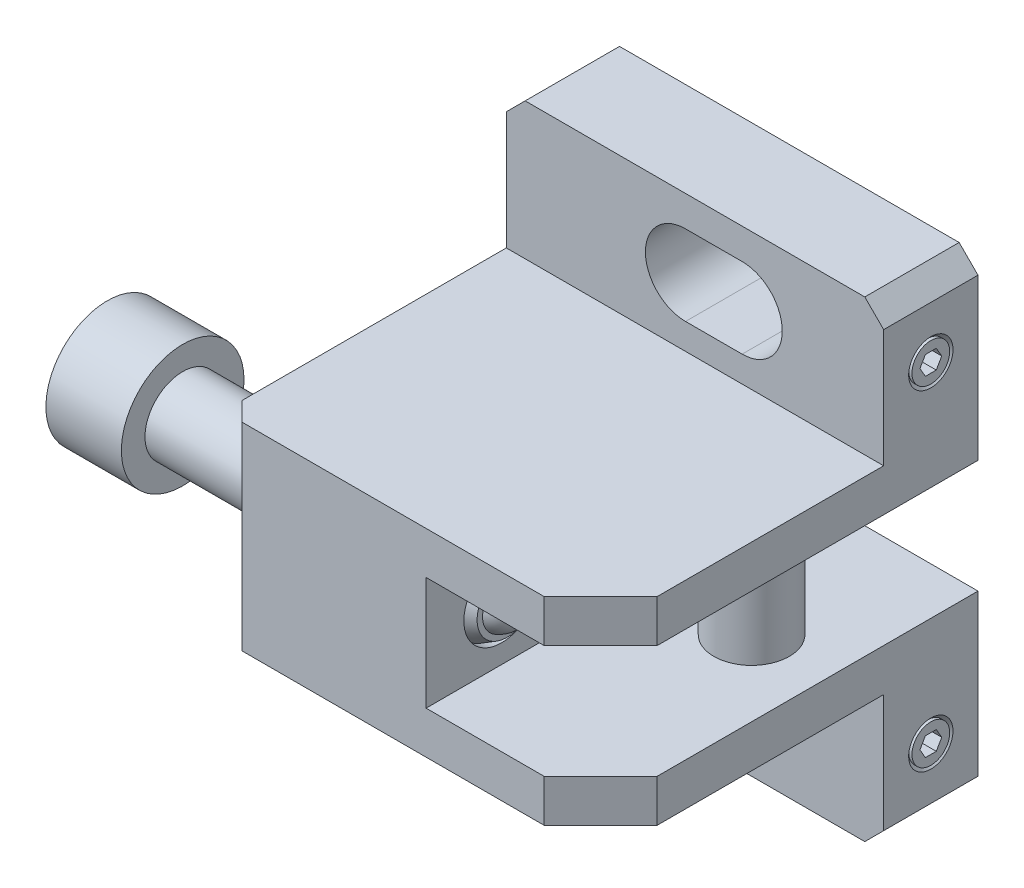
ISO-10303-21;
HEADER;
FILE_DESCRIPTION(('STEP AP214'),'2;1');
FILE_NAME('part.step','',(''),(''),'','','');
FILE_SCHEMA(('AUTOMOTIVE_DESIGN { 1 0 10303 214 1 1 1 1 }'));
ENDSEC;
DATA;
#1=APPLICATION_CONTEXT('core data for automotive mechanical design processes');
#2=APPLICATION_PROTOCOL_DEFINITION('international standard','automotive_design',2000,#1);
#3=PRODUCT_CONTEXT('',#1,'mechanical');
#4=PRODUCT('Part','Part','',(#3));
#5=PRODUCT_RELATED_PRODUCT_CATEGORY('part','',(#4));
#6=PRODUCT_DEFINITION_FORMATION('','',#4);
#7=PRODUCT_DEFINITION_CONTEXT('part definition',#1,'design');
#8=PRODUCT_DEFINITION('design','',#6,#7);
#9=PRODUCT_DEFINITION_SHAPE('','',#8);
#10=(LENGTH_UNIT() NAMED_UNIT(*) SI_UNIT(.MILLI.,.METRE.));
#11=(NAMED_UNIT(*) PLANE_ANGLE_UNIT() SI_UNIT($,.RADIAN.));
#12=(NAMED_UNIT(*) SI_UNIT($,.STERADIAN.) SOLID_ANGLE_UNIT());
#13=UNCERTAINTY_MEASURE_WITH_UNIT(LENGTH_MEASURE(1.E-05),#10,'distance_accuracy_value','');
#14=(GEOMETRIC_REPRESENTATION_CONTEXT(3) GLOBAL_UNCERTAINTY_ASSIGNED_CONTEXT((#13)) GLOBAL_UNIT_ASSIGNED_CONTEXT((#10,
#11,#12)) REPRESENTATION_CONTEXT('',''));
#15=CARTESIAN_POINT('',(0.,0.,0.));
#16=DIRECTION('',(0.,0.,1.));
#17=DIRECTION('',(1.,0.,0.));
#18=AXIS2_PLACEMENT_3D('',#15,#16,#17);
#19=CARTESIAN_POINT('',(-41.3,16.3532052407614,37.8893855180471));
#20=DIRECTION('',(-1.,0.,0.));
#21=DIRECTION('',(0.,0.191132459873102,-0.98156425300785));
#22=AXIS2_PLACEMENT_3D('',#19,#20,#21);
#23=PLANE('',#22);
#24=DIRECTION('',(0.,0.656307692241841,-0.754493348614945));
#25=VECTOR('',#24,1.);
#26=CARTESIAN_POINT('',(-41.3,18.6267217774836,35.2757438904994));
#27=LINE('',#26,#25);
#28=CARTESIAN_POINT('',(-41.3,18.6267217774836,35.2757438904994));
#29=VERTEX_POINT('',#28);
#30=CARTESIAN_POINT('',(-41.3,20.900238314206,32.6621022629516));
#31=VERTEX_POINT('',#30);
#32=EDGE_CURVE('E703',#29,#31,#27,.T.);
#33=ORIENTED_EDGE('',*,*,#32,.T.);
#34=DIRECTION('',(0.,0.325256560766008,0.945625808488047));
#35=VECTOR('',#34,1.);
#36=CARTESIAN_POINT('',(-41.3,19.7735165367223,29.3863583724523));
#37=LINE('',#36,#35);
#38=CARTESIAN_POINT('',(-41.3,19.7735165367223,29.3863583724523));
#39=VERTEX_POINT('',#38);
#40=EDGE_CURVE('E705',#39,#31,#37,.T.);
#41=ORIENTED_EDGE('',*,*,#40,.F.);
#42=DIRECTION('',(0.,0.981564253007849,0.191132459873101));
#43=VECTOR('',#42,1.);
#44=CARTESIAN_POINT('',(-41.3,16.3732782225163,28.7242561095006));
#45=LINE('',#44,#43);
#46=CARTESIAN_POINT('',(-41.3,16.3732782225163,28.7242561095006));
#47=VERTEX_POINT('',#46);
#48=EDGE_CURVE('E708',#47,#39,#45,.T.);
#49=ORIENTED_EDGE('',*,*,#48,.F.);
#50=DIRECTION('',(0.,-0.65630769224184,0.754493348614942));
#51=VECTOR('',#50,1.);
#52=CARTESIAN_POINT('',(-41.3,16.3732782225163,28.7242561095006));
#53=LINE('',#52,#51);
#54=CARTESIAN_POINT('',(-41.3,14.099761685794,31.3378977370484));
#55=VERTEX_POINT('',#54);
#56=EDGE_CURVE('E335',#47,#55,#53,.T.);
#57=ORIENTED_EDGE('',*,*,#56,.T.);
#58=DIRECTION('',(0.,-0.325256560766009,-0.945625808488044));
#59=VECTOR('',#58,1.);
#60=CARTESIAN_POINT('',(-41.3,15.2264834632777,34.6136416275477));
#61=LINE('',#60,#59);
#62=CARTESIAN_POINT('',(-41.3,15.2264834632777,34.6136416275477));
#63=VERTEX_POINT('',#62);
#64=EDGE_CURVE('E318',#63,#55,#61,.T.);
#65=ORIENTED_EDGE('',*,*,#64,.F.);
#66=DIRECTION('',(0.,0.981564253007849,0.191132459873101));
#67=VECTOR('',#66,1.);
#68=CARTESIAN_POINT('',(-41.3,15.2264834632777,34.6136416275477));
#69=LINE('',#68,#67);
#70=EDGE_CURVE('E332',#63,#29,#69,.T.);
#71=ORIENTED_EDGE('',*,*,#70,.T.);
#72=EDGE_LOOP('',(#33,#41,#49,#57,#65,#71));
#73=FACE_BOUND('',#72,.T.);
#74=ADVANCED_FACE('F14',(#73),#23,.T.);
#75=CARTESIAN_POINT('',(-41.3,19.7735165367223,29.3863583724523));
#76=DIRECTION('',(0.,-0.945625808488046,0.325256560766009));
#77=DIRECTION('',(0.,-0.325256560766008,-0.945625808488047));
#78=AXIS2_PLACEMENT_3D('',#75,#76,#77);
#79=PLANE('',#78);
#80=ORIENTED_EDGE('',*,*,#40,.T.);
#81=DIRECTION('',(-1.,0.,0.));
#82=VECTOR('',#81,1.);
#83=CARTESIAN_POINT('',(-41.3,20.900238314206,32.6621022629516));
#84=LINE('',#83,#82);
#85=CARTESIAN_POINT('',(-45.3,20.900238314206,32.6621022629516));
#86=VERTEX_POINT('',#85);
#87=EDGE_CURVE('E339',#31,#86,#84,.T.);
#88=ORIENTED_EDGE('',*,*,#87,.T.);
#89=DIRECTION('',(0.,0.325256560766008,0.945625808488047));
#90=VECTOR('',#89,1.);
#91=CARTESIAN_POINT('',(-45.3,19.7735165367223,29.3863583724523));
#92=LINE('',#91,#90);
#93=CARTESIAN_POINT('',(-45.3,19.7735165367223,29.3863583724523));
#94=VERTEX_POINT('',#93);
#95=EDGE_CURVE('E689',#94,#86,#92,.T.);
#96=ORIENTED_EDGE('',*,*,#95,.F.);
#97=DIRECTION('',(-1.,0.,0.));
#98=VECTOR('',#97,1.);
#99=CARTESIAN_POINT('',(-41.3,19.7735165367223,29.3863583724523));
#100=LINE('',#99,#98);
#101=EDGE_CURVE('E289',#39,#94,#100,.T.);
#102=ORIENTED_EDGE('',*,*,#101,.F.);
#103=EDGE_LOOP('',(#80,#88,#96,#102));
#104=FACE_BOUND('',#103,.T.);
#105=ADVANCED_FACE('F718',(#104),#79,.T.);
#106=CARTESIAN_POINT('',(-41.3,16.3732782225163,28.7242561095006));
#107=DIRECTION('',(0.,-0.191132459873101,0.981564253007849));
#108=DIRECTION('',(0.,-0.981564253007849,-0.191132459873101));
#109=AXIS2_PLACEMENT_3D('',#106,#107,#108);
#110=PLANE('',#109);
#111=ORIENTED_EDGE('',*,*,#101,.T.);
#112=DIRECTION('',(0.,0.981564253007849,0.191132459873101));
#113=VECTOR('',#112,1.);
#114=CARTESIAN_POINT('',(-45.3,16.3732782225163,28.7242561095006));
#115=LINE('',#114,#113);
#116=CARTESIAN_POINT('',(-45.3,16.3732782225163,28.7242561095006));
#117=VERTEX_POINT('',#116);
#118=EDGE_CURVE('E692',#117,#94,#115,.T.);
#119=ORIENTED_EDGE('',*,*,#118,.F.);
#120=DIRECTION('',(-1.,0.,0.));
#121=VECTOR('',#120,1.);
#122=CARTESIAN_POINT('',(-41.3,16.3732782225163,28.7242561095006));
#123=LINE('',#122,#121);
#124=EDGE_CURVE('E345',#47,#117,#123,.T.);
#125=ORIENTED_EDGE('',*,*,#124,.F.);
#126=ORIENTED_EDGE('',*,*,#48,.T.);
#127=EDGE_LOOP('',(#111,#119,#125,#126));
#128=FACE_BOUND('',#127,.T.);
#129=ADVANCED_FACE('F709',(#128),#110,.T.);
#130=CARTESIAN_POINT('',(-41.3,16.3732782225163,28.7242561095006));
#131=DIRECTION('',(0.,-0.754493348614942,-0.65630769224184));
#132=DIRECTION('',(0.,0.65630769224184,-0.754493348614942));
#133=AXIS2_PLACEMENT_3D('',#130,#131,#132);
#134=PLANE('',#133);
#135=ORIENTED_EDGE('',*,*,#124,.T.);
#136=DIRECTION('',(0.,-0.65630769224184,0.754493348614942));
#137=VECTOR('',#136,1.);
#138=CARTESIAN_POINT('',(-45.3,16.3732782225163,28.7242561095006));
#139=LINE('',#138,#137);
#140=CARTESIAN_POINT('',(-45.3,14.099761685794,31.3378977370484));
#141=VERTEX_POINT('',#140);
#142=EDGE_CURVE('E697',#117,#141,#139,.T.);
#143=ORIENTED_EDGE('',*,*,#142,.T.);
#144=DIRECTION('',(-1.,0.,0.));
#145=VECTOR('',#144,1.);
#146=CARTESIAN_POINT('',(-41.3,14.099761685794,31.3378977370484));
#147=LINE('',#146,#145);
#148=EDGE_CURVE('E326',#55,#141,#147,.T.);
#149=ORIENTED_EDGE('',*,*,#148,.F.);
#150=ORIENTED_EDGE('',*,*,#56,.F.);
#151=EDGE_LOOP('',(#135,#143,#149,#150));
#152=FACE_BOUND('',#151,.T.);
#153=ADVANCED_FACE('F712',(#152),#134,.F.);
#154=CARTESIAN_POINT('',(-41.3,15.2264834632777,34.6136416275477));
#155=DIRECTION('',(0.,0.945625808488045,-0.325256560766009));
#156=DIRECTION('',(0.,0.325256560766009,0.945625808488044));
#157=AXIS2_PLACEMENT_3D('',#154,#155,#156);
#158=PLANE('',#157);
#159=ORIENTED_EDGE('',*,*,#148,.T.);
#160=DIRECTION('',(0.,-0.325256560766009,-0.945625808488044));
#161=VECTOR('',#160,1.);
#162=CARTESIAN_POINT('',(-45.3,15.2264834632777,34.6136416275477));
#163=LINE('',#162,#161);
#164=CARTESIAN_POINT('',(-45.3,15.2264834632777,34.6136416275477));
#165=VERTEX_POINT('',#164);
#166=EDGE_CURVE('E320',#165,#141,#163,.T.);
#167=ORIENTED_EDGE('',*,*,#166,.F.);
#168=DIRECTION('',(-1.,0.,0.));
#169=VECTOR('',#168,1.);
#170=CARTESIAN_POINT('',(-41.3,15.2264834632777,34.6136416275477));
#171=LINE('',#170,#169);
#172=EDGE_CURVE('E315',#63,#165,#171,.T.);
#173=ORIENTED_EDGE('',*,*,#172,.F.);
#174=ORIENTED_EDGE('',*,*,#64,.T.);
#175=EDGE_LOOP('',(#159,#167,#173,#174));
#176=FACE_BOUND('',#175,.T.);
#177=ADVANCED_FACE('F317',(#176),#158,.T.);
#178=CARTESIAN_POINT('',(-41.3,15.2264834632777,34.6136416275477));
#179=DIRECTION('',(0.,-0.191132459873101,0.981564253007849));
#180=DIRECTION('',(0.,-0.981564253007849,-0.191132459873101));
#181=AXIS2_PLACEMENT_3D('',#178,#179,#180);
#182=PLANE('',#181);
#183=ORIENTED_EDGE('',*,*,#172,.T.);
#184=DIRECTION('',(0.,0.981564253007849,0.191132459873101));
#185=VECTOR('',#184,1.);
#186=CARTESIAN_POINT('',(-45.3,15.2264834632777,34.6136416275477));
#187=LINE('',#186,#185);
#188=CARTESIAN_POINT('',(-45.3,18.6267217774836,35.2757438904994));
#189=VERTEX_POINT('',#188);
#190=EDGE_CURVE('E701',#165,#189,#187,.T.);
#191=ORIENTED_EDGE('',*,*,#190,.T.);
#192=DIRECTION('',(-1.,0.,0.));
#193=VECTOR('',#192,1.);
#194=CARTESIAN_POINT('',(-41.3,18.6267217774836,35.2757438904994));
#195=LINE('',#194,#193);
#196=EDGE_CURVE('E325',#29,#189,#195,.T.);
#197=ORIENTED_EDGE('',*,*,#196,.F.);
#198=ORIENTED_EDGE('',*,*,#70,.F.);
#199=EDGE_LOOP('',(#183,#191,#197,#198));
#200=FACE_BOUND('',#199,.T.);
#201=ADVANCED_FACE('F337',(#200),#182,.F.);
#202=CARTESIAN_POINT('',(-41.3,18.6267217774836,35.2757438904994));
#203=DIRECTION('',(0.,0.754493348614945,0.656307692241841));
#204=DIRECTION('',(0.,-0.656307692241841,0.754493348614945));
#205=AXIS2_PLACEMENT_3D('',#202,#203,#204);
#206=PLANE('',#205);
#207=ORIENTED_EDGE('',*,*,#196,.T.);
#208=DIRECTION('',(0.,0.656307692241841,-0.754493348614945));
#209=VECTOR('',#208,1.);
#210=CARTESIAN_POINT('',(-45.3,18.6267217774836,35.2757438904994));
#211=LINE('',#210,#209);
#212=EDGE_CURVE('E33',#189,#86,#211,.T.);
#213=ORIENTED_EDGE('',*,*,#212,.T.);
#214=ORIENTED_EDGE('',*,*,#87,.F.);
#215=ORIENTED_EDGE('',*,*,#32,.F.);
#216=EDGE_LOOP('',(#207,#213,#214,#215));
#217=FACE_BOUND('',#216,.T.);
#218=ADVANCED_FACE('F719',(#217),#206,.F.);
#219=CARTESIAN_POINT('',(-45.3,16.2576390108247,38.380167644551));
#220=DIRECTION('',(-1.,0.,0.));
#221=DIRECTION('',(0.,0.191132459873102,-0.98156425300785));
#222=AXIS2_PLACEMENT_3D('',#219,#220,#221);
#223=PLANE('',#222);
#224=ORIENTED_EDGE('',*,*,#212,.F.);
#225=ORIENTED_EDGE('',*,*,#190,.F.);
#226=ORIENTED_EDGE('',*,*,#166,.T.);
#227=ORIENTED_EDGE('',*,*,#142,.F.);
#228=ORIENTED_EDGE('',*,*,#118,.T.);
#229=ORIENTED_EDGE('',*,*,#95,.T.);
#230=EDGE_LOOP('',(#224,#225,#226,#227,#228,#229));
#231=FACE_BOUND('',#230,.T.);
#232=CARTESIAN_POINT('',(-45.3,17.5,32.));
#233=DIRECTION('',(1.,0.,0.));
#234=DIRECTION('',(0.,-0.191132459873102,0.98156425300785));
#235=AXIS2_PLACEMENT_3D('',#232,#233,#234);
#236=CIRCLE('',#235,6.5);
#237=CARTESIAN_POINT('',(-45.3,16.2576390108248,38.380167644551));
#238=VERTEX_POINT('',#237);
#239=EDGE_CURVE('E349',#238,#238,#236,.T.);
#240=ORIENTED_EDGE('',*,*,#239,.F.);
#241=EDGE_LOOP('',(#240));
#242=FACE_BOUND('',#241,.T.);
#243=ADVANCED_FACE('F715',(#231,#242),#223,.T.);
#244=CARTESIAN_POINT('',(-7.3,17.5,32.));
#245=DIRECTION('',(1.,0.,0.));
#246=DIRECTION('',(0.,-0.191132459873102,0.98156425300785));
#247=AXIS2_PLACEMENT_3D('',#244,#245,#246);
#248=CYLINDRICAL_SURFACE('',#247,6.5);
#249=ORIENTED_EDGE('',*,*,#239,.T.);
#250=EDGE_LOOP('',(#249));
#251=FACE_BOUND('',#250,.T.);
#252=CARTESIAN_POINT('',(-37.3,17.5,32.));
#253=DIRECTION('',(1.,0.,0.));
#254=DIRECTION('',(0.,-0.191132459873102,0.98156425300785));
#255=AXIS2_PLACEMENT_3D('',#252,#253,#254);
#256=CIRCLE('',#255,6.5);
#257=CARTESIAN_POINT('',(-37.3,16.2576390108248,38.380167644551));
#258=VERTEX_POINT('',#257);
#259=EDGE_CURVE('E352',#258,#258,#256,.T.);
#260=ORIENTED_EDGE('',*,*,#259,.F.);
#261=EDGE_LOOP('',(#260));
#262=FACE_BOUND('',#261,.T.);
#263=ADVANCED_FACE('F728',(#251,#262),#248,.T.);
#264=CARTESIAN_POINT('',(-37.3,16.7354701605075,35.9262570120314));
#265=DIRECTION('',(1.,0.,0.));
#266=DIRECTION('',(0.,-0.191132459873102,0.98156425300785));
#267=AXIS2_PLACEMENT_3D('',#264,#265,#266);
#268=PLANE('',#267);
#269=ORIENTED_EDGE('',*,*,#259,.T.);
#270=EDGE_LOOP('',(#269));
#271=FACE_BOUND('',#270,.T.);
#272=CARTESIAN_POINT('',(-37.3,17.5,32.));
#273=DIRECTION('',(1.,0.,0.));
#274=DIRECTION('',(0.,-0.191132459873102,0.98156425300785));
#275=AXIS2_PLACEMENT_3D('',#272,#273,#274);
#276=CIRCLE('',#275,4.);
#277=CARTESIAN_POINT('',(-37.3,16.7354701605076,35.9262570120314));
#278=VERTEX_POINT('',#277);
#279=EDGE_CURVE('E355',#278,#278,#276,.T.);
#280=ORIENTED_EDGE('',*,*,#279,.F.);
#281=EDGE_LOOP('',(#280));
#282=FACE_BOUND('',#281,.T.);
#283=ADVANCED_FACE('F952',(#271,#282),#268,.T.);
#284=CARTESIAN_POINT('',(-7.3,17.5,32.));
#285=DIRECTION('',(1.,0.,0.));
#286=DIRECTION('',(0.,-0.191132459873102,0.98156425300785));
#287=AXIS2_PLACEMENT_3D('',#284,#285,#286);
#288=CYLINDRICAL_SURFACE('',#287,4.);
#289=ORIENTED_EDGE('',*,*,#279,.T.);
#290=EDGE_LOOP('',(#289));
#291=FACE_BOUND('',#290,.T.);
#292=CARTESIAN_POINT('',(-25.,17.5,32.));
#293=DIRECTION('',(1.,0.,0.));
#294=DIRECTION('',(0.,0.,-1.));
#295=AXIS2_PLACEMENT_3D('',#292,#293,#294);
#296=CIRCLE('',#295,4.);
#297=CARTESIAN_POINT('',(-25.,17.5,28.));
#298=VERTEX_POINT('',#297);
#299=EDGE_CURVE('E9',#298,#298,#296,.T.);
#300=ORIENTED_EDGE('',*,*,#299,.F.);
#301=EDGE_LOOP('',(#300));
#302=FACE_BOUND('',#301,.T.);
#303=ADVANCED_FACE('F949',(#291,#302),#288,.T.);
#304=CARTESIAN_POINT('',(-3.75000000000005,17.5,32.));
#305=DIRECTION('',(1.,0.,0.));
#306=DIRECTION('',(0.,-0.191132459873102,0.98156425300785));
#307=AXIS2_PLACEMENT_3D('',#304,#305,#306);
#308=SPHERICAL_SURFACE('',#307,2.75);
#309=CARTESIAN_POINT('',(-2.90165736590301,17.5,32.));
#310=DIRECTION('',(1.,0.,0.));
#311=DIRECTION('',(0.,-0.191132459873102,0.98156425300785));
#312=AXIS2_PLACEMENT_3D('',#309,#310,#311);
#313=CIRCLE('',#312,2.61587743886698);
#314=CARTESIAN_POINT('',(-2.90165736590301,17.0000209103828,34.5676517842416));
#315=VERTEX_POINT('',#314);
#316=EDGE_CURVE('E24',#315,#315,#313,.T.);
#317=ORIENTED_EDGE('',*,*,#316,.T.);
#318=EDGE_LOOP('',(#317));
#319=FACE_BOUND('',#318,.T.);
#320=ADVANCED_FACE('F951',(#319),#308,.T.);
#321=CARTESIAN_POINT('',(-2.901657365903,16.8899606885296,35.13286807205));
#322=DIRECTION('',(-1.,0.,0.));
#323=DIRECTION('',(0.,0.191132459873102,-0.98156425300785));
#324=AXIS2_PLACEMENT_3D('',#321,#322,#323);
#325=PLANE('',#324);
#326=ORIENTED_EDGE('',*,*,#316,.F.);
#327=EDGE_LOOP('',(#326));
#328=FACE_BOUND('',#327,.T.);
#329=CARTESIAN_POINT('',(-2.90165736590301,17.5,32.));
#330=DIRECTION('',(1.,0.,0.));
#331=DIRECTION('',(0.,-0.191132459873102,0.98156425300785));
#332=AXIS2_PLACEMENT_3D('',#329,#330,#331);
#333=CIRCLE('',#332,3.19170962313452);
#334=CARTESIAN_POINT('',(-2.90165736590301,16.8899606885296,35.13286807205));
#335=VERTEX_POINT('',#334);
#336=EDGE_CURVE('E361',#335,#335,#333,.T.);
#337=ORIENTED_EDGE('',*,*,#336,.T.);
#338=EDGE_LOOP('',(#337));
#339=FACE_BOUND('',#338,.T.);
#340=ADVANCED_FACE('F960',(#328,#339),#325,.F.);
#341=CARTESIAN_POINT('',(-4.30165736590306,17.5,32.));
#342=DIRECTION('',(-1.,0.,0.));
#343=DIRECTION('',(0.,0.191132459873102,-0.98156425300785));
#344=AXIS2_PLACEMENT_3D('',#341,#342,#343);
#345=CONICAL_SURFACE('',#344,4.,0.523598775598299);
#346=ORIENTED_EDGE('',*,*,#336,.F.);
#347=EDGE_LOOP('',(#346));
#348=FACE_BOUND('',#347,.T.);
#349=CARTESIAN_POINT('',(-4.30165736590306,17.5,32.));
#350=DIRECTION('',(1.,0.,0.));
#351=DIRECTION('',(0.,-0.191132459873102,0.98156425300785));
#352=AXIS2_PLACEMENT_3D('',#349,#350,#351);
#353=CIRCLE('',#352,4.);
#354=CARTESIAN_POINT('',(-4.30165736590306,16.7354701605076,35.9262570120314));
#355=VERTEX_POINT('',#354);
#356=EDGE_CURVE('E358',#355,#355,#353,.T.);
#357=ORIENTED_EDGE('',*,*,#356,.T.);
#358=EDGE_LOOP('',(#357));
#359=FACE_BOUND('',#358,.T.);
#360=ADVANCED_FACE('F967',(#348,#359),#345,.T.);
#361=CARTESIAN_POINT('',(13.,-1.,6.73205080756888));
#362=DIRECTION('',(1.,0.,0.));
#363=DIRECTION('',(0.,1.,0.));
#364=AXIS2_PLACEMENT_3D('',#361,#362,#363);
#365=PLANE('',#364);
#366=DIRECTION('',(0.,-0.866025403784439,0.5));
#367=VECTOR('',#366,1.);
#368=CARTESIAN_POINT('',(13.,1.,5.57735026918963));
#369=LINE('',#368,#367);
#370=CARTESIAN_POINT('',(13.,1.,5.57735026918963));
#371=VERTEX_POINT('',#370);
#372=CARTESIAN_POINT('',(13.,0.,6.15470053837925));
#373=VERTEX_POINT('',#372);
#374=EDGE_CURVE('E383',#371,#373,#369,.T.);
#375=ORIENTED_EDGE('',*,*,#374,.T.);
#376=DIRECTION('',(0.,-0.866025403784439,-0.5));
#377=VECTOR('',#376,1.);
#378=CARTESIAN_POINT('',(13.,0.,6.15470053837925));
#379=LINE('',#378,#377);
#380=CARTESIAN_POINT('',(13.,-1.,5.57735026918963));
#381=VERTEX_POINT('',#380);
#382=EDGE_CURVE('E386',#373,#381,#379,.T.);
#383=ORIENTED_EDGE('',*,*,#382,.T.);
#384=DIRECTION('',(0.,0.,-1.));
#385=VECTOR('',#384,1.);
#386=CARTESIAN_POINT('',(13.,-1.,5.57735026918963));
#387=LINE('',#386,#385);
#388=CARTESIAN_POINT('',(13.,-1.,4.42264973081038));
#389=VERTEX_POINT('',#388);
#390=EDGE_CURVE('E389',#381,#389,#387,.T.);
#391=ORIENTED_EDGE('',*,*,#390,.T.);
#392=DIRECTION('',(0.,0.866025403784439,-0.5));
#393=VECTOR('',#392,1.);
#394=CARTESIAN_POINT('',(13.,-1.,4.42264973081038));
#395=LINE('',#394,#393);
#396=CARTESIAN_POINT('',(13.,0.,3.84529946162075));
#397=VERTEX_POINT('',#396);
#398=EDGE_CURVE('E392',#389,#397,#395,.T.);
#399=ORIENTED_EDGE('',*,*,#398,.T.);
#400=DIRECTION('',(0.,0.866025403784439,0.5));
#401=VECTOR('',#400,1.);
#402=CARTESIAN_POINT('',(13.,0.,3.84529946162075));
#403=LINE('',#402,#401);
#404=CARTESIAN_POINT('',(13.,1.,4.42264973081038));
#405=VERTEX_POINT('',#404);
#406=EDGE_CURVE('E395',#397,#405,#403,.T.);
#407=ORIENTED_EDGE('',*,*,#406,.T.);
#408=DIRECTION('',(0.,0.,1.));
#409=VECTOR('',#408,1.);
#410=CARTESIAN_POINT('',(13.,1.,4.42264973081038));
#411=LINE('',#410,#409);
#412=EDGE_CURVE('E398',#405,#371,#411,.T.);
#413=ORIENTED_EDGE('',*,*,#412,.T.);
#414=EDGE_LOOP('',(#375,#383,#391,#399,#407,#413));
#415=FACE_BOUND('',#414,.T.);
#416=ADVANCED_FACE('F970',(#415),#365,.T.);
#417=CARTESIAN_POINT('',(13.,34.,6.73205080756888));
#418=DIRECTION('',(1.,0.,0.));
#419=DIRECTION('',(0.,1.,0.));
#420=AXIS2_PLACEMENT_3D('',#417,#418,#419);
#421=PLANE('',#420);
#422=DIRECTION('',(0.,-0.866025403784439,0.5));
#423=VECTOR('',#422,1.);
#424=CARTESIAN_POINT('',(13.,36.,5.57735026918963));
#425=LINE('',#424,#423);
#426=CARTESIAN_POINT('',(13.,36.,5.57735026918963));
#427=VERTEX_POINT('',#426);
#428=CARTESIAN_POINT('',(13.,35.,6.15470053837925));
#429=VERTEX_POINT('',#428);
#430=EDGE_CURVE('E434',#427,#429,#425,.T.);
#431=ORIENTED_EDGE('',*,*,#430,.T.);
#432=DIRECTION('',(0.,-0.866025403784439,-0.5));
#433=VECTOR('',#432,1.);
#434=CARTESIAN_POINT('',(13.,35.,6.15470053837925));
#435=LINE('',#434,#433);
#436=CARTESIAN_POINT('',(13.,34.,5.57735026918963));
#437=VERTEX_POINT('',#436);
#438=EDGE_CURVE('E437',#429,#437,#435,.T.);
#439=ORIENTED_EDGE('',*,*,#438,.T.);
#440=DIRECTION('',(0.,0.,-1.));
#441=VECTOR('',#440,1.);
#442=CARTESIAN_POINT('',(13.,34.,5.57735026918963));
#443=LINE('',#442,#441);
#444=CARTESIAN_POINT('',(13.,34.,4.42264973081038));
#445=VERTEX_POINT('',#444);
#446=EDGE_CURVE('E440',#437,#445,#443,.T.);
#447=ORIENTED_EDGE('',*,*,#446,.T.);
#448=DIRECTION('',(0.,0.866025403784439,-0.5));
#449=VECTOR('',#448,1.);
#450=CARTESIAN_POINT('',(13.,34.,4.42264973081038));
#451=LINE('',#450,#449);
#452=CARTESIAN_POINT('',(13.,35.,3.84529946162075));
#453=VERTEX_POINT('',#452);
#454=EDGE_CURVE('E443',#445,#453,#451,.T.);
#455=ORIENTED_EDGE('',*,*,#454,.T.);
#456=DIRECTION('',(0.,0.866025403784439,0.5));
#457=VECTOR('',#456,1.);
#458=CARTESIAN_POINT('',(13.,35.,3.84529946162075));
#459=LINE('',#458,#457);
#460=CARTESIAN_POINT('',(13.,36.,4.42264973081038));
#461=VERTEX_POINT('',#460);
#462=EDGE_CURVE('E446',#453,#461,#459,.T.);
#463=ORIENTED_EDGE('',*,*,#462,.T.);
#464=DIRECTION('',(0.,0.,1.));
#465=VECTOR('',#464,1.);
#466=CARTESIAN_POINT('',(13.,36.,4.42264973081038));
#467=LINE('',#466,#465);
#468=EDGE_CURVE('E449',#461,#427,#467,.T.);
#469=ORIENTED_EDGE('',*,*,#468,.T.);
#470=EDGE_LOOP('',(#431,#439,#447,#455,#463,#469));
#471=FACE_BOUND('',#470,.T.);
#472=ADVANCED_FACE('F771',(#471),#421,.T.);
#473=CARTESIAN_POINT('',(13.,0.,6.15470053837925));
#474=DIRECTION('',(0.,-0.5,0.866025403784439));
#475=DIRECTION('',(0.,-0.866025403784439,-0.5));
#476=AXIS2_PLACEMENT_3D('',#473,#474,#475);
#477=PLANE('',#476);
#478=DIRECTION('',(0.,-0.866025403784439,-0.5));
#479=VECTOR('',#478,1.);
#480=CARTESIAN_POINT('',(15.,0.,6.15470053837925));
#481=LINE('',#480,#479);
#482=CARTESIAN_POINT('',(15.,0.,6.15470053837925));
#483=VERTEX_POINT('',#482);
#484=CARTESIAN_POINT('',(15.,-1.,5.57735026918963));
#485=VERTEX_POINT('',#484);
#486=EDGE_CURVE('E368',#483,#485,#481,.T.);
#487=ORIENTED_EDGE('',*,*,#486,.T.);
#488=DIRECTION('',(1.,0.,0.));
#489=VECTOR('',#488,1.);
#490=CARTESIAN_POINT('',(13.,-1.,5.57735026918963));
#491=LINE('',#490,#489);
#492=EDGE_CURVE('E411',#381,#485,#491,.T.);
#493=ORIENTED_EDGE('',*,*,#492,.F.);
#494=ORIENTED_EDGE('',*,*,#382,.F.);
#495=DIRECTION('',(1.,0.,0.));
#496=VECTOR('',#495,1.);
#497=CARTESIAN_POINT('',(13.,0.,6.15470053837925));
#498=LINE('',#497,#496);
#499=EDGE_CURVE('E401',#373,#483,#498,.T.);
#500=ORIENTED_EDGE('',*,*,#499,.T.);
#501=EDGE_LOOP('',(#487,#493,#494,#500));
#502=FACE_BOUND('',#501,.T.);
#503=ADVANCED_FACE('F979',(#502),#477,.F.);
#504=CARTESIAN_POINT('',(13.,-1.,5.57735026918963));
#505=DIRECTION('',(0.,-1.,0.));
#506=DIRECTION('',(1.,0.,0.));
#507=AXIS2_PLACEMENT_3D('',#504,#505,#506);
#508=PLANE('',#507);
#509=DIRECTION('',(0.,0.,-1.));
#510=VECTOR('',#509,1.);
#511=CARTESIAN_POINT('',(15.,-1.,5.57735026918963));
#512=LINE('',#511,#510);
#513=CARTESIAN_POINT('',(15.,-1.,4.42264973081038));
#514=VERTEX_POINT('',#513);
#515=EDGE_CURVE('E371',#485,#514,#512,.T.);
#516=ORIENTED_EDGE('',*,*,#515,.T.);
#517=DIRECTION('',(1.,0.,0.));
#518=VECTOR('',#517,1.);
#519=CARTESIAN_POINT('',(13.,-1.,4.42264973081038));
#520=LINE('',#519,#518);
#521=EDGE_CURVE('E409',#389,#514,#520,.T.);
#522=ORIENTED_EDGE('',*,*,#521,.F.);
#523=ORIENTED_EDGE('',*,*,#390,.F.);
#524=ORIENTED_EDGE('',*,*,#492,.T.);
#525=EDGE_LOOP('',(#516,#522,#523,#524));
#526=FACE_BOUND('',#525,.T.);
#527=ADVANCED_FACE('F992',(#526),#508,.F.);
#528=CARTESIAN_POINT('',(13.,-1.,4.42264973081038));
#529=DIRECTION('',(0.,-0.5,-0.866025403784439));
#530=DIRECTION('',(0.,0.866025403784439,-0.5));
#531=AXIS2_PLACEMENT_3D('',#528,#529,#530);
#532=PLANE('',#531);
#533=DIRECTION('',(0.,0.866025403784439,-0.5));
#534=VECTOR('',#533,1.);
#535=CARTESIAN_POINT('',(15.,-1.,4.42264973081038));
#536=LINE('',#535,#534);
#537=CARTESIAN_POINT('',(15.,0.,3.84529946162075));
#538=VERTEX_POINT('',#537);
#539=EDGE_CURVE('E374',#514,#538,#536,.T.);
#540=ORIENTED_EDGE('',*,*,#539,.T.);
#541=DIRECTION('',(1.,0.,0.));
#542=VECTOR('',#541,1.);
#543=CARTESIAN_POINT('',(13.,0.,3.84529946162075));
#544=LINE('',#543,#542);
#545=EDGE_CURVE('E407',#397,#538,#544,.T.);
#546=ORIENTED_EDGE('',*,*,#545,.F.);
#547=ORIENTED_EDGE('',*,*,#398,.F.);
#548=ORIENTED_EDGE('',*,*,#521,.T.);
#549=EDGE_LOOP('',(#540,#546,#547,#548));
#550=FACE_BOUND('',#549,.T.);
#551=ADVANCED_FACE('F988',(#550),#532,.F.);
#552=CARTESIAN_POINT('',(13.,0.,3.84529946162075));
#553=DIRECTION('',(0.,0.5,-0.866025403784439));
#554=DIRECTION('',(0.,0.866025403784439,0.5));
#555=AXIS2_PLACEMENT_3D('',#552,#553,#554);
#556=PLANE('',#555);
#557=DIRECTION('',(0.,0.866025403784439,0.5));
#558=VECTOR('',#557,1.);
#559=CARTESIAN_POINT('',(15.,0.,3.84529946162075));
#560=LINE('',#559,#558);
#561=CARTESIAN_POINT('',(15.,1.,4.42264973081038));
#562=VERTEX_POINT('',#561);
#563=EDGE_CURVE('E377',#538,#562,#560,.T.);
#564=ORIENTED_EDGE('',*,*,#563,.T.);
#565=DIRECTION('',(1.,0.,0.));
#566=VECTOR('',#565,1.);
#567=CARTESIAN_POINT('',(13.,1.,4.42264973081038));
#568=LINE('',#567,#566);
#569=EDGE_CURVE('E405',#405,#562,#568,.T.);
#570=ORIENTED_EDGE('',*,*,#569,.F.);
#571=ORIENTED_EDGE('',*,*,#406,.F.);
#572=ORIENTED_EDGE('',*,*,#545,.T.);
#573=EDGE_LOOP('',(#564,#570,#571,#572));
#574=FACE_BOUND('',#573,.T.);
#575=ADVANCED_FACE('F984',(#574),#556,.F.);
#576=CARTESIAN_POINT('',(13.,1.,4.42264973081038));
#577=DIRECTION('',(0.,1.,0.));
#578=DIRECTION('',(-1.,0.,0.));
#579=AXIS2_PLACEMENT_3D('',#576,#577,#578);
#580=PLANE('',#579);
#581=DIRECTION('',(0.,0.,1.));
#582=VECTOR('',#581,1.);
#583=CARTESIAN_POINT('',(15.,1.,4.42264973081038));
#584=LINE('',#583,#582);
#585=CARTESIAN_POINT('',(15.,1.,5.57735026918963));
#586=VERTEX_POINT('',#585);
#587=EDGE_CURVE('E380',#562,#586,#584,.T.);
#588=ORIENTED_EDGE('',*,*,#587,.T.);
#589=DIRECTION('',(1.,0.,0.));
#590=VECTOR('',#589,1.);
#591=CARTESIAN_POINT('',(13.,1.,5.57735026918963));
#592=LINE('',#591,#590);
#593=EDGE_CURVE('E402',#371,#586,#592,.T.);
#594=ORIENTED_EDGE('',*,*,#593,.F.);
#595=ORIENTED_EDGE('',*,*,#412,.F.);
#596=ORIENTED_EDGE('',*,*,#569,.T.);
#597=EDGE_LOOP('',(#588,#594,#595,#596));
#598=FACE_BOUND('',#597,.T.);
#599=ADVANCED_FACE('F980',(#598),#580,.F.);
#600=CARTESIAN_POINT('',(13.,1.,5.57735026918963));
#601=DIRECTION('',(0.,0.5,0.866025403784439));
#602=DIRECTION('',(0.,-0.866025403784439,0.5));
#603=AXIS2_PLACEMENT_3D('',#600,#601,#602);
#604=PLANE('',#603);
#605=DIRECTION('',(0.,-0.866025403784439,0.5));
#606=VECTOR('',#605,1.);
#607=CARTESIAN_POINT('',(15.,1.,5.57735026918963));
#608=LINE('',#607,#606);
#609=EDGE_CURVE('E366',#586,#483,#608,.T.);
#610=ORIENTED_EDGE('',*,*,#609,.T.);
#611=ORIENTED_EDGE('',*,*,#499,.F.);
#612=ORIENTED_EDGE('',*,*,#374,.F.);
#613=ORIENTED_EDGE('',*,*,#593,.T.);
#614=EDGE_LOOP('',(#610,#611,#612,#613));
#615=FACE_BOUND('',#614,.T.);
#616=ADVANCED_FACE('F983',(#615),#604,.F.);
#617=CARTESIAN_POINT('',(13.,35.,6.15470053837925));
#618=DIRECTION('',(0.,-0.5,0.866025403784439));
#619=DIRECTION('',(0.,-0.866025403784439,-0.5));
#620=AXIS2_PLACEMENT_3D('',#617,#618,#619);
#621=PLANE('',#620);
#622=DIRECTION('',(0.,-0.866025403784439,-0.5));
#623=VECTOR('',#622,1.);
#624=CARTESIAN_POINT('',(15.,35.,6.15470053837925));
#625=LINE('',#624,#623);
#626=CARTESIAN_POINT('',(15.,35.,6.15470053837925));
#627=VERTEX_POINT('',#626);
#628=CARTESIAN_POINT('',(15.,34.,5.57735026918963));
#629=VERTEX_POINT('',#628);
#630=EDGE_CURVE('E419',#627,#629,#625,.T.);
#631=ORIENTED_EDGE('',*,*,#630,.T.);
#632=DIRECTION('',(1.,0.,0.));
#633=VECTOR('',#632,1.);
#634=CARTESIAN_POINT('',(13.,34.,5.57735026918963));
#635=LINE('',#634,#633);
#636=EDGE_CURVE('E462',#437,#629,#635,.T.);
#637=ORIENTED_EDGE('',*,*,#636,.F.);
#638=ORIENTED_EDGE('',*,*,#438,.F.);
#639=DIRECTION('',(1.,0.,0.));
#640=VECTOR('',#639,1.);
#641=CARTESIAN_POINT('',(13.,35.,6.15470053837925));
#642=LINE('',#641,#640);
#643=EDGE_CURVE('E452',#429,#627,#642,.T.);
#644=ORIENTED_EDGE('',*,*,#643,.T.);
#645=EDGE_LOOP('',(#631,#637,#638,#644));
#646=FACE_BOUND('',#645,.T.);
#647=ADVANCED_FACE('F1002',(#646),#621,.F.);
#648=CARTESIAN_POINT('',(13.,34.,5.57735026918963));
#649=DIRECTION('',(0.,-1.,0.));
#650=DIRECTION('',(1.,0.,0.));
#651=AXIS2_PLACEMENT_3D('',#648,#649,#650);
#652=PLANE('',#651);
#653=DIRECTION('',(0.,0.,-1.));
#654=VECTOR('',#653,1.);
#655=CARTESIAN_POINT('',(15.,34.,5.57735026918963));
#656=LINE('',#655,#654);
#657=CARTESIAN_POINT('',(15.,34.,4.42264973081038));
#658=VERTEX_POINT('',#657);
#659=EDGE_CURVE('E422',#629,#658,#656,.T.);
#660=ORIENTED_EDGE('',*,*,#659,.T.);
#661=DIRECTION('',(1.,0.,0.));
#662=VECTOR('',#661,1.);
#663=CARTESIAN_POINT('',(13.,34.,4.42264973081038));
#664=LINE('',#663,#662);
#665=EDGE_CURVE('E460',#445,#658,#664,.T.);
#666=ORIENTED_EDGE('',*,*,#665,.F.);
#667=ORIENTED_EDGE('',*,*,#446,.F.);
#668=ORIENTED_EDGE('',*,*,#636,.T.);
#669=EDGE_LOOP('',(#660,#666,#667,#668));
#670=FACE_BOUND('',#669,.T.);
#671=ADVANCED_FACE('F1027',(#670),#652,.F.);
#672=CARTESIAN_POINT('',(13.,34.,4.42264973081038));
#673=DIRECTION('',(0.,-0.5,-0.866025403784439));
#674=DIRECTION('',(0.,0.866025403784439,-0.5));
#675=AXIS2_PLACEMENT_3D('',#672,#673,#674);
#676=PLANE('',#675);
#677=DIRECTION('',(0.,0.866025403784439,-0.5));
#678=VECTOR('',#677,1.);
#679=CARTESIAN_POINT('',(15.,34.,4.42264973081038));
#680=LINE('',#679,#678);
#681=CARTESIAN_POINT('',(15.,35.,3.84529946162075));
#682=VERTEX_POINT('',#681);
#683=EDGE_CURVE('E425',#658,#682,#680,.T.);
#684=ORIENTED_EDGE('',*,*,#683,.T.);
#685=DIRECTION('',(1.,0.,0.));
#686=VECTOR('',#685,1.);
#687=CARTESIAN_POINT('',(13.,35.,3.84529946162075));
#688=LINE('',#687,#686);
#689=EDGE_CURVE('E458',#453,#682,#688,.T.);
#690=ORIENTED_EDGE('',*,*,#689,.F.);
#691=ORIENTED_EDGE('',*,*,#454,.F.);
#692=ORIENTED_EDGE('',*,*,#665,.T.);
#693=EDGE_LOOP('',(#684,#690,#691,#692));
#694=FACE_BOUND('',#693,.T.);
#695=ADVANCED_FACE('F1023',(#694),#676,.F.);
#696=CARTESIAN_POINT('',(13.,35.,3.84529946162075));
#697=DIRECTION('',(0.,0.5,-0.866025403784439));
#698=DIRECTION('',(0.,0.866025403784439,0.5));
#699=AXIS2_PLACEMENT_3D('',#696,#697,#698);
#700=PLANE('',#699);
#701=DIRECTION('',(0.,0.866025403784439,0.5));
#702=VECTOR('',#701,1.);
#703=CARTESIAN_POINT('',(15.,35.,3.84529946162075));
#704=LINE('',#703,#702);
#705=CARTESIAN_POINT('',(15.,36.,4.42264973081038));
#706=VERTEX_POINT('',#705);
#707=EDGE_CURVE('E428',#682,#706,#704,.T.);
#708=ORIENTED_EDGE('',*,*,#707,.T.);
#709=DIRECTION('',(1.,0.,0.));
#710=VECTOR('',#709,1.);
#711=CARTESIAN_POINT('',(13.,36.,4.42264973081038));
#712=LINE('',#711,#710);
#713=EDGE_CURVE('E456',#461,#706,#712,.T.);
#714=ORIENTED_EDGE('',*,*,#713,.F.);
#715=ORIENTED_EDGE('',*,*,#462,.F.);
#716=ORIENTED_EDGE('',*,*,#689,.T.);
#717=EDGE_LOOP('',(#708,#714,#715,#716));
#718=FACE_BOUND('',#717,.T.);
#719=ADVANCED_FACE('F1019',(#718),#700,.F.);
#720=CARTESIAN_POINT('',(13.,36.,4.42264973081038));
#721=DIRECTION('',(0.,1.,0.));
#722=DIRECTION('',(-1.,0.,0.));
#723=AXIS2_PLACEMENT_3D('',#720,#721,#722);
#724=PLANE('',#723);
#725=DIRECTION('',(0.,0.,1.));
#726=VECTOR('',#725,1.);
#727=CARTESIAN_POINT('',(15.,36.,4.42264973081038));
#728=LINE('',#727,#726);
#729=CARTESIAN_POINT('',(15.,36.,5.57735026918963));
#730=VERTEX_POINT('',#729);
#731=EDGE_CURVE('E431',#706,#730,#728,.T.);
#732=ORIENTED_EDGE('',*,*,#731,.T.);
#733=DIRECTION('',(1.,0.,0.));
#734=VECTOR('',#733,1.);
#735=CARTESIAN_POINT('',(13.,36.,5.57735026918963));
#736=LINE('',#735,#734);
#737=EDGE_CURVE('E453',#427,#730,#736,.T.);
#738=ORIENTED_EDGE('',*,*,#737,.F.);
#739=ORIENTED_EDGE('',*,*,#468,.F.);
#740=ORIENTED_EDGE('',*,*,#713,.T.);
#741=EDGE_LOOP('',(#732,#738,#739,#740));
#742=FACE_BOUND('',#741,.T.);
#743=ADVANCED_FACE('F1016',(#742),#724,.F.);
#744=CARTESIAN_POINT('',(13.,36.,5.57735026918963));
#745=DIRECTION('',(0.,0.5,0.866025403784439));
#746=DIRECTION('',(0.,-0.866025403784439,0.5));
#747=AXIS2_PLACEMENT_3D('',#744,#745,#746);
#748=PLANE('',#747);
#749=DIRECTION('',(0.,-0.866025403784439,0.5));
#750=VECTOR('',#749,1.);
#751=CARTESIAN_POINT('',(15.,36.,5.57735026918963));
#752=LINE('',#751,#750);
#753=EDGE_CURVE('E417',#730,#627,#752,.T.);
#754=ORIENTED_EDGE('',*,*,#753,.T.);
#755=ORIENTED_EDGE('',*,*,#643,.F.);
#756=ORIENTED_EDGE('',*,*,#430,.F.);
#757=ORIENTED_EDGE('',*,*,#737,.T.);
#758=EDGE_LOOP('',(#754,#755,#756,#757));
#759=FACE_BOUND('',#758,.T.);
#760=ADVANCED_FACE('F1008',(#759),#748,.F.);
#761=CARTESIAN_POINT('',(15.,0.,5.));
#762=DIRECTION('',(1.,0.,0.));
#763=DIRECTION('',(0.,1.,0.));
#764=AXIS2_PLACEMENT_3D('',#761,#762,#763);
#765=PLANE('',#764);
#766=ORIENTED_EDGE('',*,*,#609,.F.);
#767=ORIENTED_EDGE('',*,*,#587,.F.);
#768=ORIENTED_EDGE('',*,*,#563,.F.);
#769=ORIENTED_EDGE('',*,*,#539,.F.);
#770=ORIENTED_EDGE('',*,*,#515,.F.);
#771=ORIENTED_EDGE('',*,*,#486,.F.);
#772=EDGE_LOOP('',(#766,#767,#768,#769,#770,#771));
#773=FACE_BOUND('',#772,.T.);
#774=CARTESIAN_POINT('',(15.,0.,5.));
#775=DIRECTION('',(1.,0.,0.));
#776=DIRECTION('',(0.,1.,0.));
#777=AXIS2_PLACEMENT_3D('',#774,#775,#776);
#778=CIRCLE('',#777,2.);
#779=CARTESIAN_POINT('',(15.,2.,5.));
#780=VERTEX_POINT('',#779);
#781=EDGE_CURVE('E404',#780,#780,#778,.T.);
#782=ORIENTED_EDGE('',*,*,#781,.T.);
#783=EDGE_LOOP('',(#782));
#784=FACE_BOUND('',#783,.T.);
#785=ADVANCED_FACE('F1004',(#773,#784),#765,.T.);
#786=CARTESIAN_POINT('',(15.,35.,5.));
#787=DIRECTION('',(1.,0.,0.));
#788=DIRECTION('',(0.,1.,0.));
#789=AXIS2_PLACEMENT_3D('',#786,#787,#788);
#790=PLANE('',#789);
#791=ORIENTED_EDGE('',*,*,#753,.F.);
#792=ORIENTED_EDGE('',*,*,#731,.F.);
#793=ORIENTED_EDGE('',*,*,#707,.F.);
#794=ORIENTED_EDGE('',*,*,#683,.F.);
#795=ORIENTED_EDGE('',*,*,#659,.F.);
#796=ORIENTED_EDGE('',*,*,#630,.F.);
#797=EDGE_LOOP('',(#791,#792,#793,#794,#795,#796));
#798=FACE_BOUND('',#797,.T.);
#799=CARTESIAN_POINT('',(15.,35.,5.));
#800=DIRECTION('',(1.,0.,0.));
#801=DIRECTION('',(0.,1.,0.));
#802=AXIS2_PLACEMENT_3D('',#799,#800,#801);
#803=CIRCLE('',#802,2.);
#804=CARTESIAN_POINT('',(15.,37.,5.));
#805=VERTEX_POINT('',#804);
#806=EDGE_CURVE('E455',#805,#805,#803,.T.);
#807=ORIENTED_EDGE('',*,*,#806,.T.);
#808=EDGE_LOOP('',(#807));
#809=FACE_BOUND('',#808,.T.);
#810=ADVANCED_FACE('F1007',(#798,#809),#790,.T.);
#811=CARTESIAN_POINT('',(15.,0.,5.));
#812=DIRECTION('',(-1.,0.,0.));
#813=DIRECTION('',(0.,-1.,0.));
#814=AXIS2_PLACEMENT_3D('',#811,#812,#813);
#815=CYLINDRICAL_SURFACE('',#814,2.);
#816=ORIENTED_EDGE('',*,*,#781,.F.);
#817=EDGE_LOOP('',(#816));
#818=FACE_BOUND('',#817,.T.);
#819=CARTESIAN_POINT('',(14.65,0.,5.));
#820=DIRECTION('',(1.,0.,0.));
#821=DIRECTION('',(0.,0.,-1.));
#822=AXIS2_PLACEMENT_3D('',#819,#820,#821);
#823=CIRCLE('',#822,2.);
#824=CARTESIAN_POINT('',(14.65,0.,3.));
#825=VERTEX_POINT('',#824);
#826=EDGE_CURVE('E677',#825,#825,#823,.T.);
#827=ORIENTED_EDGE('',*,*,#826,.T.);
#828=EDGE_LOOP('',(#827));
#829=FACE_BOUND('',#828,.T.);
#830=ADVANCED_FACE('F844',(#818,#829),#815,.T.);
#831=CARTESIAN_POINT('',(15.,35.,5.));
#832=DIRECTION('',(-1.,0.,0.));
#833=DIRECTION('',(0.,-1.,0.));
#834=AXIS2_PLACEMENT_3D('',#831,#832,#833);
#835=CYLINDRICAL_SURFACE('',#834,2.);
#836=ORIENTED_EDGE('',*,*,#806,.F.);
#837=EDGE_LOOP('',(#836));
#838=FACE_BOUND('',#837,.T.);
#839=CARTESIAN_POINT('',(14.65,35.,5.));
#840=DIRECTION('',(1.,0.,0.));
#841=DIRECTION('',(0.,0.,-1.));
#842=AXIS2_PLACEMENT_3D('',#839,#840,#841);
#843=CIRCLE('',#842,2.);
#844=CARTESIAN_POINT('',(14.65,35.,3.));
#845=VERTEX_POINT('',#844);
#846=EDGE_CURVE('E680',#845,#845,#843,.T.);
#847=ORIENTED_EDGE('',*,*,#846,.T.);
#848=EDGE_LOOP('',(#847));
#849=FACE_BOUND('',#848,.T.);
#850=ADVANCED_FACE('F978',(#838,#849),#835,.T.);
#851=CARTESIAN_POINT('',(15.,0.,5.));
#852=DIRECTION('',(1.,0.,0.));
#853=DIRECTION('',(0.,1.,0.));
#854=AXIS2_PLACEMENT_3D('',#851,#852,#853);
#855=CONICAL_SURFACE('',#854,2.35,0.785398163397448);
#856=CARTESIAN_POINT('',(15.,0.,5.));
#857=DIRECTION('',(1.,0.,0.));
#858=DIRECTION('',(0.,1.,0.));
#859=AXIS2_PLACEMENT_3D('',#856,#857,#858);
#860=CIRCLE('',#859,2.35);
#861=CARTESIAN_POINT('',(15.,2.35,5.));
#862=VERTEX_POINT('',#861);
#863=EDGE_CURVE('E468',#862,#862,#860,.T.);
#864=ORIENTED_EDGE('',*,*,#863,.T.);
#865=EDGE_LOOP('',(#864));
#866=FACE_BOUND('',#865,.T.);
#867=ORIENTED_EDGE('',*,*,#826,.F.);
#868=EDGE_LOOP('',(#867));
#869=FACE_BOUND('',#868,.T.);
#870=ADVANCED_FACE('F799',(#866,#869),#855,.F.);
#871=CARTESIAN_POINT('',(7.,28.,16.));
#872=DIRECTION('',(0.,-1.,0.));
#873=DIRECTION('',(-1.,0.,0.));
#874=AXIS2_PLACEMENT_3D('',#871,#872,#873);
#875=CYLINDRICAL_SURFACE('',#874,4.);
#876=CARTESIAN_POINT('',(7.,11.5,16.));
#877=DIRECTION('',(0.,-1.,0.));
#878=DIRECTION('',(0.,0.,-1.));
#879=AXIS2_PLACEMENT_3D('',#876,#877,#878);
#880=CIRCLE('',#879,4.);
#881=CARTESIAN_POINT('',(7.,11.5,12.));
#882=VERTEX_POINT('',#881);
#883=EDGE_CURVE('E682',#882,#882,#880,.T.);
#884=ORIENTED_EDGE('',*,*,#883,.F.);
#885=EDGE_LOOP('',(#884));
#886=FACE_BOUND('',#885,.T.);
#887=CARTESIAN_POINT('',(7.,23.5,16.));
#888=DIRECTION('',(0.,1.,0.));
#889=DIRECTION('',(0.,0.,1.));
#890=AXIS2_PLACEMENT_3D('',#887,#888,#889);
#891=CIRCLE('',#890,4.);
#892=CARTESIAN_POINT('',(7.,23.5,20.));
#893=VERTEX_POINT('',#892);
#894=EDGE_CURVE('E18',#893,#893,#891,.T.);
#895=ORIENTED_EDGE('',*,*,#894,.F.);
#896=EDGE_LOOP('',(#895));
#897=FACE_BOUND('',#896,.T.);
#898=ADVANCED_FACE('F16',(#886,#897),#875,.T.);
#899=CARTESIAN_POINT('',(15.,35.,5.));
#900=DIRECTION('',(1.,0.,0.));
#901=DIRECTION('',(0.,1.,0.));
#902=AXIS2_PLACEMENT_3D('',#899,#900,#901);
#903=CONICAL_SURFACE('',#902,2.35,0.785398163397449);
#904=CARTESIAN_POINT('',(15.,35.,5.));
#905=DIRECTION('',(1.,0.,0.));
#906=DIRECTION('',(0.,1.,0.));
#907=AXIS2_PLACEMENT_3D('',#904,#905,#906);
#908=CIRCLE('',#907,2.35);
#909=CARTESIAN_POINT('',(15.,37.35,5.));
#910=VERTEX_POINT('',#909);
#911=EDGE_CURVE('E471',#910,#910,#908,.T.);
#912=ORIENTED_EDGE('',*,*,#911,.T.);
#913=EDGE_LOOP('',(#912));
#914=FACE_BOUND('',#913,.T.);
#915=ORIENTED_EDGE('',*,*,#846,.F.);
#916=EDGE_LOOP('',(#915));
#917=FACE_BOUND('',#916,.T.);
#918=ADVANCED_FACE('F788',(#914,#917),#903,.F.);
#919=CARTESIAN_POINT('',(15.,28.,34.));
#920=DIRECTION('',(-0.707106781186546,0.,-0.707106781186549));
#921=DIRECTION('',(-0.707106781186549,0.,0.707106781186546));
#922=AXIS2_PLACEMENT_3D('',#919,#920,#921);
#923=PLANE('',#922);
#924=DIRECTION('',(-0.707106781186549,0.,0.707106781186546));
#925=VECTOR('',#924,1.);
#926=CARTESIAN_POINT('',(-8.,28.,57.));
#927=LINE('',#926,#925);
#928=CARTESIAN_POINT('',(9.,28.,40.));
#929=VERTEX_POINT('',#928);
#930=CARTESIAN_POINT('',(15.,28.,34.));
#931=VERTEX_POINT('',#930);
#932=EDGE_CURVE('E671',#929,#931,#927,.F.);
#933=ORIENTED_EDGE('',*,*,#932,.F.);
#934=DIRECTION('',(0.,1.,0.));
#935=VECTOR('',#934,1.);
#936=CARTESIAN_POINT('',(9.,7.,40.));
#937=LINE('',#936,#935);
#938=CARTESIAN_POINT('',(9.,23.5,40.));
#939=VERTEX_POINT('',#938);
#940=EDGE_CURVE('E669',#939,#929,#937,.T.);
#941=ORIENTED_EDGE('',*,*,#940,.F.);
#942=DIRECTION('',(0.707106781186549,0.,-0.707106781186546));
#943=VECTOR('',#942,1.);
#944=CARTESIAN_POINT('',(15.,23.5,34.));
#945=LINE('',#944,#943);
#946=CARTESIAN_POINT('',(15.,23.5,34.));
#947=VERTEX_POINT('',#946);
#948=EDGE_CURVE('E665',#947,#939,#945,.F.);
#949=ORIENTED_EDGE('',*,*,#948,.F.);
#950=DIRECTION('',(0.,-1.,0.));
#951=VECTOR('',#950,1.);
#952=CARTESIAN_POINT('',(15.,28.,34.));
#953=LINE('',#952,#951);
#954=EDGE_CURVE('E662',#931,#947,#953,.T.);
#955=ORIENTED_EDGE('',*,*,#954,.F.);
#956=EDGE_LOOP('',(#933,#941,#949,#955));
#957=FACE_BOUND('',#956,.T.);
#958=ADVANCED_FACE('F747',(#957),#923,.F.);
#959=CARTESIAN_POINT('',(-25.,7.,40.));
#960=DIRECTION('',(0.,0.,1.));
#961=DIRECTION('',(1.,0.,0.));
#962=AXIS2_PLACEMENT_3D('',#959,#960,#961);
#963=PLANE('',#962);
#964=DIRECTION('',(-1.,0.,0.));
#965=VECTOR('',#964,1.);
#966=CARTESIAN_POINT('',(15.,23.5,40.));
#967=LINE('',#966,#965);
#968=CARTESIAN_POINT('',(-3.5,23.5,40.));
#969=VERTEX_POINT('',#968);
#970=EDGE_CURVE('E534',#939,#969,#967,.T.);
#971=ORIENTED_EDGE('',*,*,#970,.F.);
#972=ORIENTED_EDGE('',*,*,#940,.T.);
#973=DIRECTION('',(1.,0.,0.));
#974=VECTOR('',#973,1.);
#975=CARTESIAN_POINT('',(-25.,28.,40.));
#976=LINE('',#975,#974);
#977=CARTESIAN_POINT('',(-23.,28.,40.));
#978=VERTEX_POINT('',#977);
#979=EDGE_CURVE('E593',#978,#929,#976,.T.);
#980=ORIENTED_EDGE('',*,*,#979,.F.);
#981=DIRECTION('',(0.,-1.,0.));
#982=VECTOR('',#981,1.);
#983=CARTESIAN_POINT('',(-23.,7.,40.));
#984=LINE('',#983,#982);
#985=CARTESIAN_POINT('',(-23.,7.,40.));
#986=VERTEX_POINT('',#985);
#987=EDGE_CURVE('E597',#978,#986,#984,.T.);
#988=ORIENTED_EDGE('',*,*,#987,.T.);
#989=DIRECTION('',(1.,0.,0.));
#990=VECTOR('',#989,1.);
#991=CARTESIAN_POINT('',(-25.,7.,40.));
#992=LINE('',#991,#990);
#993=CARTESIAN_POINT('',(9.,7.,40.));
#994=VERTEX_POINT('',#993);
#995=EDGE_CURVE('E609',#986,#994,#992,.T.);
#996=ORIENTED_EDGE('',*,*,#995,.T.);
#997=DIRECTION('',(0.,1.,0.));
#998=VECTOR('',#997,1.);
#999=CARTESIAN_POINT('',(9.,7.,40.));
#1000=LINE('',#999,#998);
#1001=CARTESIAN_POINT('',(9.,11.5,40.));
#1002=VERTEX_POINT('',#1001);
#1003=EDGE_CURVE('E667',#994,#1002,#1000,.T.);
#1004=ORIENTED_EDGE('',*,*,#1003,.T.);
#1005=DIRECTION('',(1.,0.,0.));
#1006=VECTOR('',#1005,1.);
#1007=CARTESIAN_POINT('',(15.,11.5,40.));
#1008=LINE('',#1007,#1006);
#1009=CARTESIAN_POINT('',(-3.5,11.5,40.));
#1010=VERTEX_POINT('',#1009);
#1011=EDGE_CURVE('E546',#1010,#1002,#1008,.T.);
#1012=ORIENTED_EDGE('',*,*,#1011,.F.);
#1013=DIRECTION('',(0.,-1.,0.));
#1014=VECTOR('',#1013,1.);
#1015=CARTESIAN_POINT('',(-3.5,23.5,40.));
#1016=LINE('',#1015,#1014);
#1017=EDGE_CURVE('E543',#969,#1010,#1016,.T.);
#1018=ORIENTED_EDGE('',*,*,#1017,.F.);
#1019=EDGE_LOOP('',(#971,#972,#980,#988,#996,#1004,#1012,#1018));
#1020=FACE_BOUND('',#1019,.T.);
#1021=ADVANCED_FACE('F753',(#1020),#963,.T.);
#1022=CARTESIAN_POINT('',(15.,28.,34.));
#1023=DIRECTION('',(-0.707106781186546,0.,-0.707106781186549));
#1024=DIRECTION('',(-0.707106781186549,0.,0.707106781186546));
#1025=AXIS2_PLACEMENT_3D('',#1022,#1023,#1024);
#1026=PLANE('',#1025);
#1027=DIRECTION('',(-0.707106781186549,0.,0.707106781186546));
#1028=VECTOR('',#1027,1.);
#1029=CARTESIAN_POINT('',(15.,11.5,34.));
#1030=LINE('',#1029,#1028);
#1031=CARTESIAN_POINT('',(15.,11.5,34.));
#1032=VERTEX_POINT('',#1031);
#1033=EDGE_CURVE('E273',#1002,#1032,#1030,.F.);
#1034=ORIENTED_EDGE('',*,*,#1033,.F.);
#1035=ORIENTED_EDGE('',*,*,#1003,.F.);
#1036=DIRECTION('',(0.707106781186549,0.,-0.707106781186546));
#1037=VECTOR('',#1036,1.);
#1038=CARTESIAN_POINT('',(-8.,7.,57.));
#1039=LINE('',#1038,#1037);
#1040=CARTESIAN_POINT('',(15.,7.,34.));
#1041=VERTEX_POINT('',#1040);
#1042=EDGE_CURVE('E280',#1041,#994,#1039,.F.);
#1043=ORIENTED_EDGE('',*,*,#1042,.F.);
#1044=DIRECTION('',(0.,-1.,0.));
#1045=VECTOR('',#1044,1.);
#1046=CARTESIAN_POINT('',(15.,28.,34.));
#1047=LINE('',#1046,#1045);
#1048=EDGE_CURVE('E673',#1032,#1041,#1047,.T.);
#1049=ORIENTED_EDGE('',*,*,#1048,.F.);
#1050=EDGE_LOOP('',(#1034,#1035,#1043,#1049));
#1051=FACE_BOUND('',#1050,.T.);
#1052=ADVANCED_FACE('F778',(#1051),#1026,.F.);
#1053=CARTESIAN_POINT('',(15.,-5.5,40.));
#1054=DIRECTION('',(-0.707106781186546,0.707106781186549,0.));
#1055=DIRECTION('',(-0.707106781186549,-0.707106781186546,0.));
#1056=AXIS2_PLACEMENT_3D('',#1053,#1054,#1055);
#1057=PLANE('',#1056);
#1058=DIRECTION('',(-0.707106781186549,-0.707106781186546,0.));
#1059=VECTOR('',#1058,1.);
#1060=CARTESIAN_POINT('',(1.25,-19.25,10.));
#1061=LINE('',#1060,#1059);
#1062=CARTESIAN_POINT('',(13.,-7.5,10.));
#1063=VERTEX_POINT('',#1062);
#1064=CARTESIAN_POINT('',(15.,-5.5,10.));
#1065=VERTEX_POINT('',#1064);
#1066=EDGE_CURVE('E633',#1063,#1065,#1061,.F.);
#1067=ORIENTED_EDGE('',*,*,#1066,.F.);
#1068=DIRECTION('',(0.,0.,1.));
#1069=VECTOR('',#1068,1.);
#1070=CARTESIAN_POINT('',(13.,-7.5,10.));
#1071=LINE('',#1070,#1069);
#1072=CARTESIAN_POINT('',(13.,-7.5,0.));
#1073=VERTEX_POINT('',#1072);
#1074=EDGE_CURVE('E630',#1073,#1063,#1071,.T.);
#1075=ORIENTED_EDGE('',*,*,#1074,.F.);
#1076=DIRECTION('',(0.707106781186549,0.707106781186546,0.));
#1077=VECTOR('',#1076,1.);
#1078=CARTESIAN_POINT('',(19.,-1.5,0.));
#1079=LINE('',#1078,#1077);
#1080=CARTESIAN_POINT('',(15.,-5.5,0.));
#1081=VERTEX_POINT('',#1080);
#1082=EDGE_CURVE('E627',#1081,#1073,#1079,.F.);
#1083=ORIENTED_EDGE('',*,*,#1082,.F.);
#1084=DIRECTION('',(0.,0.,-1.));
#1085=VECTOR('',#1084,1.);
#1086=CARTESIAN_POINT('',(15.,-5.5,40.));
#1087=LINE('',#1086,#1085);
#1088=EDGE_CURVE('E622',#1065,#1081,#1087,.T.);
#1089=ORIENTED_EDGE('',*,*,#1088,.F.);
#1090=EDGE_LOOP('',(#1067,#1075,#1083,#1089));
#1091=FACE_BOUND('',#1090,.T.);
#1092=ADVANCED_FACE('F786',(#1091),#1057,.F.);
#1093=CARTESIAN_POINT('',(15.,28.,40.));
#1094=DIRECTION('',(1.,0.,0.));
#1095=DIRECTION('',(0.,1.,0.));
#1096=AXIS2_PLACEMENT_3D('',#1093,#1094,#1095);
#1097=PLANE('',#1096);
#1098=ORIENTED_EDGE('',*,*,#863,.F.);
#1099=EDGE_LOOP('',(#1098));
#1100=FACE_BOUND('',#1099,.T.);
#1101=DIRECTION('',(0.,0.,1.));
#1102=VECTOR('',#1101,1.);
#1103=CARTESIAN_POINT('',(15.,11.5,0.));
#1104=LINE('',#1103,#1102);
#1105=CARTESIAN_POINT('',(15.,11.5,0.));
#1106=VERTEX_POINT('',#1105);
#1107=EDGE_CURVE('E562',#1106,#1032,#1104,.T.);
#1108=ORIENTED_EDGE('',*,*,#1107,.T.);
#1109=ORIENTED_EDGE('',*,*,#1048,.T.);
#1110=DIRECTION('',(0.,0.,-1.));
#1111=VECTOR('',#1110,1.);
#1112=CARTESIAN_POINT('',(15.,7.,40.));
#1113=LINE('',#1112,#1111);
#1114=CARTESIAN_POINT('',(15.,7.,10.));
#1115=VERTEX_POINT('',#1114);
#1116=EDGE_CURVE('E570',#1041,#1115,#1113,.T.);
#1117=ORIENTED_EDGE('',*,*,#1116,.T.);
#1118=DIRECTION('',(0.,-1.,0.));
#1119=VECTOR('',#1118,1.);
#1120=CARTESIAN_POINT('',(15.,7.,10.));
#1121=LINE('',#1120,#1119);
#1122=EDGE_CURVE('E572',#1115,#1065,#1121,.T.);
#1123=ORIENTED_EDGE('',*,*,#1122,.T.);
#1124=ORIENTED_EDGE('',*,*,#1088,.T.);
#1125=DIRECTION('',(0.,1.,0.));
#1126=VECTOR('',#1125,1.);
#1127=CARTESIAN_POINT('',(15.,42.5,0.));
#1128=LINE('',#1127,#1126);
#1129=EDGE_CURVE('E576',#1081,#1106,#1128,.T.);
#1130=ORIENTED_EDGE('',*,*,#1129,.T.);
#1131=EDGE_LOOP('',(#1108,#1109,#1117,#1123,#1124,#1130));
#1132=FACE_BOUND('',#1131,.T.);
#1133=ADVANCED_FACE('F824',(#1100,#1132),#1097,.T.);
#1134=CARTESIAN_POINT('',(15.,11.5,0.));
#1135=DIRECTION('',(0.,-1.,0.));
#1136=DIRECTION('',(1.,0.,0.));
#1137=AXIS2_PLACEMENT_3D('',#1134,#1135,#1136);
#1138=PLANE('',#1137);
#1139=ORIENTED_EDGE('',*,*,#883,.T.);
#1140=EDGE_LOOP('',(#1139));
#1141=FACE_BOUND('',#1140,.T.);
#1142=ORIENTED_EDGE('',*,*,#1011,.T.);
#1143=ORIENTED_EDGE('',*,*,#1033,.T.);
#1144=ORIENTED_EDGE('',*,*,#1107,.F.);
#1145=DIRECTION('',(1.,0.,0.));
#1146=VECTOR('',#1145,1.);
#1147=CARTESIAN_POINT('',(15.,11.5,0.));
#1148=LINE('',#1147,#1146);
#1149=CARTESIAN_POINT('',(-3.5,11.5,0.));
#1150=VERTEX_POINT('',#1149);
#1151=EDGE_CURVE('E554',#1150,#1106,#1148,.T.);
#1152=ORIENTED_EDGE('',*,*,#1151,.F.);
#1153=DIRECTION('',(0.,0.,1.));
#1154=VECTOR('',#1153,1.);
#1155=CARTESIAN_POINT('',(-3.5,11.5,0.));
#1156=LINE('',#1155,#1154);
#1157=EDGE_CURVE('E564',#1150,#1010,#1156,.T.);
#1158=ORIENTED_EDGE('',*,*,#1157,.T.);
#1159=EDGE_LOOP('',(#1142,#1143,#1144,#1152,#1158));
#1160=FACE_BOUND('',#1159,.T.);
#1161=ADVANCED_FACE('F749',(#1141,#1160),#1138,.F.);
#1162=CARTESIAN_POINT('',(-3.5,23.5,0.));
#1163=DIRECTION('',(-1.,0.,0.));
#1164=DIRECTION('',(0.,-1.,0.));
#1165=AXIS2_PLACEMENT_3D('',#1162,#1163,#1164);
#1166=PLANE('',#1165);
#1167=CARTESIAN_POINT('',(-3.5,17.5,32.));
#1168=DIRECTION('',(-1.,0.,0.));
#1169=DIRECTION('',(0.,-1.,0.));
#1170=AXIS2_PLACEMENT_3D('',#1167,#1168,#1169);
#1171=CIRCLE('',#1170,4.);
#1172=CARTESIAN_POINT('',(-3.5,13.5,32.));
#1173=VERTEX_POINT('',#1172);
#1174=EDGE_CURVE('E474',#1173,#1173,#1171,.T.);
#1175=ORIENTED_EDGE('',*,*,#1174,.T.);
#1176=EDGE_LOOP('',(#1175));
#1177=FACE_BOUND('',#1176,.T.);
#1178=ORIENTED_EDGE('',*,*,#1017,.T.);
#1179=ORIENTED_EDGE('',*,*,#1157,.F.);
#1180=DIRECTION('',(0.,-1.,0.));
#1181=VECTOR('',#1180,1.);
#1182=CARTESIAN_POINT('',(-3.5,23.5,0.));
#1183=LINE('',#1182,#1181);
#1184=CARTESIAN_POINT('',(-3.5,23.5,0.));
#1185=VERTEX_POINT('',#1184);
#1186=EDGE_CURVE('E551',#1185,#1150,#1183,.T.);
#1187=ORIENTED_EDGE('',*,*,#1186,.F.);
#1188=DIRECTION('',(0.,0.,1.));
#1189=VECTOR('',#1188,1.);
#1190=CARTESIAN_POINT('',(-3.5,23.5,0.));
#1191=LINE('',#1190,#1189);
#1192=EDGE_CURVE('E557',#1185,#969,#1191,.T.);
#1193=ORIENTED_EDGE('',*,*,#1192,.T.);
#1194=EDGE_LOOP('',(#1178,#1179,#1187,#1193));
#1195=FACE_BOUND('',#1194,.T.);
#1196=ADVANCED_FACE('F736',(#1177,#1195),#1166,.F.);
#1197=CARTESIAN_POINT('',(-25.,17.5,32.));
#1198=DIRECTION('',(-1.,0.,0.));
#1199=DIRECTION('',(0.,-1.,0.));
#1200=AXIS2_PLACEMENT_3D('',#1197,#1198,#1199);
#1201=CYLINDRICAL_SURFACE('',#1200,4.);
#1202=ORIENTED_EDGE('',*,*,#356,.F.);
#1203=EDGE_LOOP('',(#1202));
#1204=FACE_BOUND('',#1203,.T.);
#1205=ORIENTED_EDGE('',*,*,#1174,.F.);
#1206=EDGE_LOOP('',(#1205));
#1207=FACE_BOUND('',#1206,.T.);
#1208=ADVANCED_FACE('F733',(#1204,#1207),#1201,.F.);
#1209=CARTESIAN_POINT('',(15.,23.5,0.));
#1210=DIRECTION('',(0.,1.,0.));
#1211=DIRECTION('',(-1.,0.,0.));
#1212=AXIS2_PLACEMENT_3D('',#1209,#1210,#1211);
#1213=PLANE('',#1212);
#1214=ORIENTED_EDGE('',*,*,#894,.T.);
#1215=EDGE_LOOP('',(#1214));
#1216=FACE_BOUND('',#1215,.T.);
#1217=DIRECTION('',(0.,0.,1.));
#1218=VECTOR('',#1217,1.);
#1219=CARTESIAN_POINT('',(15.,23.5,0.));
#1220=LINE('',#1219,#1218);
#1221=CARTESIAN_POINT('',(15.,23.5,0.));
#1222=VERTEX_POINT('',#1221);
#1223=EDGE_CURVE('E558',#1222,#947,#1220,.T.);
#1224=ORIENTED_EDGE('',*,*,#1223,.T.);
#1225=ORIENTED_EDGE('',*,*,#948,.T.);
#1226=ORIENTED_EDGE('',*,*,#970,.T.);
#1227=ORIENTED_EDGE('',*,*,#1192,.F.);
#1228=DIRECTION('',(-1.,0.,0.));
#1229=VECTOR('',#1228,1.);
#1230=CARTESIAN_POINT('',(15.,23.5,0.));
#1231=LINE('',#1230,#1229);
#1232=EDGE_CURVE('E548',#1222,#1185,#1231,.T.);
#1233=ORIENTED_EDGE('',*,*,#1232,.F.);
#1234=EDGE_LOOP('',(#1224,#1225,#1226,#1227,#1233));
#1235=FACE_BOUND('',#1234,.T.);
#1236=ADVANCED_FACE('F735',(#1216,#1235),#1213,.F.);
#1237=ORIENTED_EDGE('',*,*,#911,.F.);
#1238=EDGE_LOOP('',(#1237));
#1239=FACE_BOUND('',#1238,.T.);
#1240=DIRECTION('',(0.,0.,1.));
#1241=VECTOR('',#1240,1.);
#1242=CARTESIAN_POINT('',(15.,28.,40.));
#1243=LINE('',#1242,#1241);
#1244=CARTESIAN_POINT('',(15.,28.,10.));
#1245=VERTEX_POINT('',#1244);
#1246=EDGE_CURVE('E561',#1245,#931,#1243,.T.);
#1247=ORIENTED_EDGE('',*,*,#1246,.T.);
#1248=ORIENTED_EDGE('',*,*,#954,.T.);
#1249=ORIENTED_EDGE('',*,*,#1223,.F.);
#1250=CARTESIAN_POINT('',(15.,40.5,0.));
#1251=VERTEX_POINT('',#1250);
#1252=EDGE_CURVE('E575',#1222,#1251,#1128,.T.);
#1253=ORIENTED_EDGE('',*,*,#1252,.T.);
#1254=DIRECTION('',(0.,0.,1.));
#1255=VECTOR('',#1254,1.);
#1256=CARTESIAN_POINT('',(15.,40.5,40.));
#1257=LINE('',#1256,#1255);
#1258=CARTESIAN_POINT('',(15.,40.5,10.));
#1259=VERTEX_POINT('',#1258);
#1260=EDGE_CURVE('E635',#1251,#1259,#1257,.T.);
#1261=ORIENTED_EDGE('',*,*,#1260,.T.);
#1262=DIRECTION('',(0.,-1.,0.));
#1263=VECTOR('',#1262,1.);
#1264=CARTESIAN_POINT('',(15.,28.,10.));
#1265=LINE('',#1264,#1263);
#1266=EDGE_CURVE('E578',#1259,#1245,#1265,.T.);
#1267=ORIENTED_EDGE('',*,*,#1266,.T.);
#1268=EDGE_LOOP('',(#1247,#1248,#1249,#1253,#1261,#1267));
#1269=FACE_BOUND('',#1268,.T.);
#1270=ADVANCED_FACE('F745',(#1239,#1269),#1097,.T.);
#1271=CARTESIAN_POINT('',(15.,40.5,40.));
#1272=DIRECTION('',(-0.707106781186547,-0.707106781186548,0.));
#1273=DIRECTION('',(0.707106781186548,-0.707106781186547,0.));
#1274=AXIS2_PLACEMENT_3D('',#1271,#1272,#1273);
#1275=PLANE('',#1274);
#1276=DIRECTION('',(-0.707106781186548,0.707106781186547,0.));
#1277=VECTOR('',#1276,1.);
#1278=CARTESIAN_POINT('',(-6.,61.5,0.));
#1279=LINE('',#1278,#1277);
#1280=CARTESIAN_POINT('',(13.,42.5,0.));
#1281=VERTEX_POINT('',#1280);
#1282=EDGE_CURVE('E625',#1281,#1251,#1279,.F.);
#1283=ORIENTED_EDGE('',*,*,#1282,.F.);
#1284=DIRECTION('',(0.,0.,-1.));
#1285=VECTOR('',#1284,1.);
#1286=CARTESIAN_POINT('',(13.,42.5,10.));
#1287=LINE('',#1286,#1285);
#1288=CARTESIAN_POINT('',(13.,42.5,10.));
#1289=VERTEX_POINT('',#1288);
#1290=EDGE_CURVE('E641',#1289,#1281,#1287,.T.);
#1291=ORIENTED_EDGE('',*,*,#1290,.F.);
#1292=DIRECTION('',(0.707106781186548,-0.707106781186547,0.));
#1293=VECTOR('',#1292,1.);
#1294=CARTESIAN_POINT('',(1.25,54.25,10.));
#1295=LINE('',#1294,#1293);
#1296=EDGE_CURVE('E638',#1259,#1289,#1295,.F.);
#1297=ORIENTED_EDGE('',*,*,#1296,.F.);
#1298=ORIENTED_EDGE('',*,*,#1260,.F.);
#1299=EDGE_LOOP('',(#1283,#1291,#1297,#1298));
#1300=FACE_BOUND('',#1299,.T.);
#1301=ADVANCED_FACE('F748',(#1300),#1275,.F.);
#1302=CARTESIAN_POINT('',(-25.,42.5,10.));
#1303=DIRECTION('',(0.,1.,0.));
#1304=DIRECTION('',(0.,0.,1.));
#1305=AXIS2_PLACEMENT_3D('',#1302,#1303,#1304);
#1306=PLANE('',#1305);
#1307=DIRECTION('',(1.,0.,0.));
#1308=VECTOR('',#1307,1.);
#1309=CARTESIAN_POINT('',(-25.,42.5,0.));
#1310=LINE('',#1309,#1308);
#1311=CARTESIAN_POINT('',(-23.,42.5,0.));
#1312=VERTEX_POINT('',#1311);
#1313=EDGE_CURVE('E600',#1312,#1281,#1310,.T.);
#1314=ORIENTED_EDGE('',*,*,#1313,.F.);
#1315=DIRECTION('',(0.,0.,1.));
#1316=VECTOR('',#1315,1.);
#1317=CARTESIAN_POINT('',(-23.,42.5,10.));
#1318=LINE('',#1317,#1316);
#1319=CARTESIAN_POINT('',(-23.,42.5,10.));
#1320=VERTEX_POINT('',#1319);
#1321=EDGE_CURVE('E657',#1312,#1320,#1318,.T.);
#1322=ORIENTED_EDGE('',*,*,#1321,.T.);
#1323=DIRECTION('',(1.,0.,0.));
#1324=VECTOR('',#1323,1.);
#1325=CARTESIAN_POINT('',(-25.,42.5,10.));
#1326=LINE('',#1325,#1324);
#1327=EDGE_CURVE('E598',#1320,#1289,#1326,.T.);
#1328=ORIENTED_EDGE('',*,*,#1327,.T.);
#1329=ORIENTED_EDGE('',*,*,#1290,.T.);
#1330=EDGE_LOOP('',(#1314,#1322,#1328,#1329));
#1331=FACE_BOUND('',#1330,.T.);
#1332=ADVANCED_FACE('F752',(#1331),#1306,.T.);
#1333=CARTESIAN_POINT('',(-25.,-7.5,10.));
#1334=DIRECTION('',(0.,-1.,0.));
#1335=DIRECTION('',(0.,0.,-1.));
#1336=AXIS2_PLACEMENT_3D('',#1333,#1334,#1335);
#1337=PLANE('',#1336);
#1338=DIRECTION('',(1.,0.,0.));
#1339=VECTOR('',#1338,1.);
#1340=CARTESIAN_POINT('',(-25.,-7.5,10.));
#1341=LINE('',#1340,#1339);
#1342=CARTESIAN_POINT('',(-23.,-7.5,10.));
#1343=VERTEX_POINT('',#1342);
#1344=EDGE_CURVE('E604',#1343,#1063,#1341,.T.);
#1345=ORIENTED_EDGE('',*,*,#1344,.F.);
#1346=DIRECTION('',(0.,0.,-1.));
#1347=VECTOR('',#1346,1.);
#1348=CARTESIAN_POINT('',(-23.,-7.5,0.));
#1349=LINE('',#1348,#1347);
#1350=CARTESIAN_POINT('',(-23.,-7.5,0.));
#1351=VERTEX_POINT('',#1350);
#1352=EDGE_CURVE('E644',#1343,#1351,#1349,.T.);
#1353=ORIENTED_EDGE('',*,*,#1352,.T.);
#1354=DIRECTION('',(1.,0.,0.));
#1355=VECTOR('',#1354,1.);
#1356=CARTESIAN_POINT('',(-25.,-7.5,0.));
#1357=LINE('',#1356,#1355);
#1358=EDGE_CURVE('E602',#1351,#1073,#1357,.T.);
#1359=ORIENTED_EDGE('',*,*,#1358,.T.);
#1360=ORIENTED_EDGE('',*,*,#1074,.T.);
#1361=EDGE_LOOP('',(#1345,#1353,#1359,#1360));
#1362=FACE_BOUND('',#1361,.T.);
#1363=ADVANCED_FACE('F800',(#1362),#1337,.T.);
#1364=CARTESIAN_POINT('',(-6.,39.25,0.));
#1365=DIRECTION('',(0.,1.,0.));
#1366=DIRECTION('',(-1.,0.,0.));
#1367=AXIS2_PLACEMENT_3D('',#1364,#1365,#1366);
#1368=PLANE('',#1367);
#1369=DIRECTION('',(-1.,0.,0.));
#1370=VECTOR('',#1369,1.);
#1371=CARTESIAN_POINT('',(-6.,39.25,10.));
#1372=LINE('',#1371,#1370);
#1373=CARTESIAN_POINT('',(0.,39.25,10.));
#1374=VERTEX_POINT('',#1373);
#1375=CARTESIAN_POINT('',(-6.,39.25,10.));
#1376=VERTEX_POINT('',#1375);
#1377=EDGE_CURVE('E516',#1374,#1376,#1372,.T.);
#1378=ORIENTED_EDGE('',*,*,#1377,.T.);
#1379=DIRECTION('',(0.,0.,1.));
#1380=VECTOR('',#1379,1.);
#1381=CARTESIAN_POINT('',(-6.,39.25,0.));
#1382=LINE('',#1381,#1380);
#1383=CARTESIAN_POINT('',(-6.,39.25,0.));
#1384=VERTEX_POINT('',#1383);
#1385=EDGE_CURVE('E532',#1384,#1376,#1382,.T.);
#1386=ORIENTED_EDGE('',*,*,#1385,.F.);
#1387=DIRECTION('',(-1.,0.,0.));
#1388=VECTOR('',#1387,1.);
#1389=CARTESIAN_POINT('',(-6.,39.25,0.));
#1390=LINE('',#1389,#1388);
#1391=CARTESIAN_POINT('',(0.,39.25,0.));
#1392=VERTEX_POINT('',#1391);
#1393=EDGE_CURVE('E528',#1392,#1384,#1390,.T.);
#1394=ORIENTED_EDGE('',*,*,#1393,.F.);
#1395=DIRECTION('',(0.,0.,1.));
#1396=VECTOR('',#1395,1.);
#1397=CARTESIAN_POINT('',(0.,39.25,0.));
#1398=LINE('',#1397,#1396);
#1399=EDGE_CURVE('E535',#1392,#1374,#1398,.T.);
#1400=ORIENTED_EDGE('',*,*,#1399,.T.);
#1401=EDGE_LOOP('',(#1378,#1386,#1394,#1400));
#1402=FACE_BOUND('',#1401,.T.);
#1403=ADVANCED_FACE('F803',(#1402),#1368,.F.);
#1404=CARTESIAN_POINT('',(0.,35.,0.));
#1405=DIRECTION('',(0.,0.,1.));
#1406=DIRECTION('',(1.,0.,0.));
#1407=AXIS2_PLACEMENT_3D('',#1404,#1405,#1406);
#1408=CYLINDRICAL_SURFACE('',#1407,4.25);
#1409=CARTESIAN_POINT('',(0.,35.,10.));
#1410=DIRECTION('',(0.,0.,1.));
#1411=DIRECTION('',(-1.,0.,0.));
#1412=AXIS2_PLACEMENT_3D('',#1409,#1410,#1411);
#1413=CIRCLE('',#1412,4.25);
#1414=CARTESIAN_POINT('',(0.,30.75,10.));
#1415=VERTEX_POINT('',#1414);
#1416=EDGE_CURVE('E514',#1415,#1374,#1413,.T.);
#1417=ORIENTED_EDGE('',*,*,#1416,.T.);
#1418=ORIENTED_EDGE('',*,*,#1399,.F.);
#1419=CARTESIAN_POINT('',(0.,35.,0.));
#1420=DIRECTION('',(0.,0.,1.));
#1421=DIRECTION('',(-1.,0.,0.));
#1422=AXIS2_PLACEMENT_3D('',#1419,#1420,#1421);
#1423=CIRCLE('',#1422,4.25);
#1424=CARTESIAN_POINT('',(0.,30.75,0.));
#1425=VERTEX_POINT('',#1424);
#1426=EDGE_CURVE('E525',#1425,#1392,#1423,.T.);
#1427=ORIENTED_EDGE('',*,*,#1426,.F.);
#1428=DIRECTION('',(0.,0.,1.));
#1429=VECTOR('',#1428,1.);
#1430=CARTESIAN_POINT('',(0.,30.75,0.));
#1431=LINE('',#1430,#1429);
#1432=EDGE_CURVE('E538',#1425,#1415,#1431,.T.);
#1433=ORIENTED_EDGE('',*,*,#1432,.T.);
#1434=EDGE_LOOP('',(#1417,#1418,#1427,#1433));
#1435=FACE_BOUND('',#1434,.T.);
#1436=ADVANCED_FACE('F812',(#1435),#1408,.F.);
#1437=CARTESIAN_POINT('',(-6.,30.75,0.));
#1438=DIRECTION('',(0.,-1.,0.));
#1439=DIRECTION('',(1.,0.,0.));
#1440=AXIS2_PLACEMENT_3D('',#1437,#1438,#1439);
#1441=PLANE('',#1440);
#1442=DIRECTION('',(1.,0.,0.));
#1443=VECTOR('',#1442,1.);
#1444=CARTESIAN_POINT('',(-6.,30.75,10.));
#1445=LINE('',#1444,#1443);
#1446=CARTESIAN_POINT('',(-6.,30.75,10.));
#1447=VERTEX_POINT('',#1446);
#1448=EDGE_CURVE('E511',#1447,#1415,#1445,.T.);
#1449=ORIENTED_EDGE('',*,*,#1448,.T.);
#1450=ORIENTED_EDGE('',*,*,#1432,.F.);
#1451=DIRECTION('',(1.,0.,0.));
#1452=VECTOR('',#1451,1.);
#1453=CARTESIAN_POINT('',(-6.,30.75,0.));
#1454=LINE('',#1453,#1452);
#1455=CARTESIAN_POINT('',(-6.,30.75,0.));
#1456=VERTEX_POINT('',#1455);
#1457=EDGE_CURVE('E522',#1456,#1425,#1454,.T.);
#1458=ORIENTED_EDGE('',*,*,#1457,.F.);
#1459=DIRECTION('',(0.,0.,1.));
#1460=VECTOR('',#1459,1.);
#1461=CARTESIAN_POINT('',(-6.,30.75,0.));
#1462=LINE('',#1461,#1460);
#1463=EDGE_CURVE('E531',#1456,#1447,#1462,.T.);
#1464=ORIENTED_EDGE('',*,*,#1463,.T.);
#1465=EDGE_LOOP('',(#1449,#1450,#1458,#1464));
#1466=FACE_BOUND('',#1465,.T.);
#1467=ADVANCED_FACE('F791',(#1466),#1441,.F.);
#1468=CARTESIAN_POINT('',(-6.,35.,0.));
#1469=DIRECTION('',(0.,0.,1.));
#1470=DIRECTION('',(1.,0.,0.));
#1471=AXIS2_PLACEMENT_3D('',#1468,#1469,#1470);
#1472=CYLINDRICAL_SURFACE('',#1471,4.25);
#1473=CARTESIAN_POINT('',(-6.,35.,10.));
#1474=DIRECTION('',(0.,0.,1.));
#1475=DIRECTION('',(-1.,0.,0.));
#1476=AXIS2_PLACEMENT_3D('',#1473,#1474,#1475);
#1477=CIRCLE('',#1476,4.25);
#1478=EDGE_CURVE('E502',#1376,#1447,#1477,.T.);
#1479=ORIENTED_EDGE('',*,*,#1478,.T.);
#1480=ORIENTED_EDGE('',*,*,#1463,.F.);
#1481=CARTESIAN_POINT('',(-6.,35.,0.));
#1482=DIRECTION('',(0.,0.,1.));
#1483=DIRECTION('',(-1.,0.,0.));
#1484=AXIS2_PLACEMENT_3D('',#1481,#1482,#1483);
#1485=CIRCLE('',#1484,4.25);
#1486=EDGE_CURVE('E519',#1384,#1456,#1485,.T.);
#1487=ORIENTED_EDGE('',*,*,#1486,.F.);
#1488=ORIENTED_EDGE('',*,*,#1385,.T.);
#1489=EDGE_LOOP('',(#1479,#1480,#1487,#1488));
#1490=FACE_BOUND('',#1489,.T.);
#1491=ADVANCED_FACE('F805',(#1490),#1472,.F.);
#1492=CARTESIAN_POINT('',(-6.,4.25,0.));
#1493=DIRECTION('',(0.,1.,0.));
#1494=DIRECTION('',(-1.,0.,0.));
#1495=AXIS2_PLACEMENT_3D('',#1492,#1493,#1494);
#1496=PLANE('',#1495);
#1497=DIRECTION('',(-1.,0.,0.));
#1498=VECTOR('',#1497,1.);
#1499=CARTESIAN_POINT('',(-6.,4.25,10.));
#1500=LINE('',#1499,#1498);
#1501=CARTESIAN_POINT('',(0.,4.25,10.));
#1502=VERTEX_POINT('',#1501);
#1503=CARTESIAN_POINT('',(-6.,4.25,10.));
#1504=VERTEX_POINT('',#1503);
#1505=EDGE_CURVE('E484',#1502,#1504,#1500,.T.);
#1506=ORIENTED_EDGE('',*,*,#1505,.T.);
#1507=DIRECTION('',(0.,0.,1.));
#1508=VECTOR('',#1507,1.);
#1509=CARTESIAN_POINT('',(-6.,4.25,0.));
#1510=LINE('',#1509,#1508);
#1511=CARTESIAN_POINT('',(-6.,4.25,0.));
#1512=VERTEX_POINT('',#1511);
#1513=EDGE_CURVE('E500',#1512,#1504,#1510,.T.);
#1514=ORIENTED_EDGE('',*,*,#1513,.F.);
#1515=DIRECTION('',(-1.,0.,0.));
#1516=VECTOR('',#1515,1.);
#1517=CARTESIAN_POINT('',(-6.,4.25,0.));
#1518=LINE('',#1517,#1516);
#1519=CARTESIAN_POINT('',(0.,4.25,0.));
#1520=VERTEX_POINT('',#1519);
#1521=EDGE_CURVE('E496',#1520,#1512,#1518,.T.);
#1522=ORIENTED_EDGE('',*,*,#1521,.F.);
#1523=DIRECTION('',(0.,0.,1.));
#1524=VECTOR('',#1523,1.);
#1525=CARTESIAN_POINT('',(0.,4.25,0.));
#1526=LINE('',#1525,#1524);
#1527=EDGE_CURVE('E503',#1520,#1502,#1526,.T.);
#1528=ORIENTED_EDGE('',*,*,#1527,.T.);
#1529=EDGE_LOOP('',(#1506,#1514,#1522,#1528));
#1530=FACE_BOUND('',#1529,.T.);
#1531=ADVANCED_FACE('F811',(#1530),#1496,.F.);
#1532=CARTESIAN_POINT('',(0.,0.,0.));
#1533=DIRECTION('',(0.,0.,1.));
#1534=DIRECTION('',(1.,0.,0.));
#1535=AXIS2_PLACEMENT_3D('',#1532,#1533,#1534);
#1536=CYLINDRICAL_SURFACE('',#1535,4.25);
#1537=CARTESIAN_POINT('',(0.,0.,10.));
#1538=DIRECTION('',(0.,0.,1.));
#1539=DIRECTION('',(1.,0.,0.));
#1540=AXIS2_PLACEMENT_3D('',#1537,#1538,#1539);
#1541=CIRCLE('',#1540,4.25);
#1542=CARTESIAN_POINT('',(0.,-4.25,10.));
#1543=VERTEX_POINT('',#1542);
#1544=EDGE_CURVE('E482',#1543,#1502,#1541,.T.);
#1545=ORIENTED_EDGE('',*,*,#1544,.T.);
#1546=ORIENTED_EDGE('',*,*,#1527,.F.);
#1547=CARTESIAN_POINT('',(0.,0.,0.));
#1548=DIRECTION('',(0.,0.,1.));
#1549=DIRECTION('',(1.,0.,0.));
#1550=AXIS2_PLACEMENT_3D('',#1547,#1548,#1549);
#1551=CIRCLE('',#1550,4.25);
#1552=CARTESIAN_POINT('',(0.,-4.25,0.));
#1553=VERTEX_POINT('',#1552);
#1554=EDGE_CURVE('E493',#1553,#1520,#1551,.T.);
#1555=ORIENTED_EDGE('',*,*,#1554,.F.);
#1556=DIRECTION('',(0.,0.,1.));
#1557=VECTOR('',#1556,1.);
#1558=CARTESIAN_POINT('',(0.,-4.25,0.));
#1559=LINE('',#1558,#1557);
#1560=EDGE_CURVE('E506',#1553,#1543,#1559,.T.);
#1561=ORIENTED_EDGE('',*,*,#1560,.T.);
#1562=EDGE_LOOP('',(#1545,#1546,#1555,#1561));
#1563=FACE_BOUND('',#1562,.T.);
#1564=ADVANCED_FACE('F798',(#1563),#1536,.F.);
#1565=CARTESIAN_POINT('',(-6.,-4.25,0.));
#1566=DIRECTION('',(0.,-1.,0.));
#1567=DIRECTION('',(1.,0.,0.));
#1568=AXIS2_PLACEMENT_3D('',#1565,#1566,#1567);
#1569=PLANE('',#1568);
#1570=DIRECTION('',(1.,0.,0.));
#1571=VECTOR('',#1570,1.);
#1572=CARTESIAN_POINT('',(-6.,-4.25,10.));
#1573=LINE('',#1572,#1571);
#1574=CARTESIAN_POINT('',(-6.,-4.25,10.));
#1575=VERTEX_POINT('',#1574);
#1576=EDGE_CURVE('E479',#1575,#1543,#1573,.T.);
#1577=ORIENTED_EDGE('',*,*,#1576,.T.);
#1578=ORIENTED_EDGE('',*,*,#1560,.F.);
#1579=DIRECTION('',(1.,0.,0.));
#1580=VECTOR('',#1579,1.);
#1581=CARTESIAN_POINT('',(-6.,-4.25,0.));
#1582=LINE('',#1581,#1580);
#1583=CARTESIAN_POINT('',(-6.,-4.25,0.));
#1584=VERTEX_POINT('',#1583);
#1585=EDGE_CURVE('E490',#1584,#1553,#1582,.T.);
#1586=ORIENTED_EDGE('',*,*,#1585,.F.);
#1587=DIRECTION('',(0.,0.,1.));
#1588=VECTOR('',#1587,1.);
#1589=CARTESIAN_POINT('',(-6.,-4.25,0.));
#1590=LINE('',#1589,#1588);
#1591=EDGE_CURVE('E499',#1584,#1575,#1590,.T.);
#1592=ORIENTED_EDGE('',*,*,#1591,.T.);
#1593=EDGE_LOOP('',(#1577,#1578,#1586,#1592));
#1594=FACE_BOUND('',#1593,.T.);
#1595=ADVANCED_FACE('F828',(#1594),#1569,.F.);
#1596=CARTESIAN_POINT('',(-6.,0.,0.));
#1597=DIRECTION('',(0.,0.,1.));
#1598=DIRECTION('',(1.,0.,0.));
#1599=AXIS2_PLACEMENT_3D('',#1596,#1597,#1598);
#1600=CYLINDRICAL_SURFACE('',#1599,4.25);
#1601=CARTESIAN_POINT('',(-6.,0.,10.));
#1602=DIRECTION('',(0.,0.,1.));
#1603=DIRECTION('',(1.,0.,0.));
#1604=AXIS2_PLACEMENT_3D('',#1601,#1602,#1603);
#1605=CIRCLE('',#1604,4.25);
#1606=EDGE_CURVE('E477',#1504,#1575,#1605,.T.);
#1607=ORIENTED_EDGE('',*,*,#1606,.T.);
#1608=ORIENTED_EDGE('',*,*,#1591,.F.);
#1609=CARTESIAN_POINT('',(-6.,0.,0.));
#1610=DIRECTION('',(0.,0.,1.));
#1611=DIRECTION('',(1.,0.,0.));
#1612=AXIS2_PLACEMENT_3D('',#1609,#1610,#1611);
#1613=CIRCLE('',#1612,4.25);
#1614=EDGE_CURVE('E487',#1512,#1584,#1613,.T.);
#1615=ORIENTED_EDGE('',*,*,#1614,.F.);
#1616=ORIENTED_EDGE('',*,*,#1513,.T.);
#1617=EDGE_LOOP('',(#1607,#1608,#1615,#1616));
#1618=FACE_BOUND('',#1617,.T.);
#1619=ADVANCED_FACE('F823',(#1618),#1600,.F.);
#1620=CARTESIAN_POINT('',(-23.,42.5,10.));
#1621=DIRECTION('',(-0.707106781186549,0.707106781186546,0.));
#1622=DIRECTION('',(-0.707106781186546,-0.707106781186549,0.));
#1623=AXIS2_PLACEMENT_3D('',#1620,#1621,#1622);
#1624=PLANE('',#1623);
#1625=DIRECTION('',(0.707106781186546,0.707106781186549,0.));
#1626=VECTOR('',#1625,1.);
#1627=CARTESIAN_POINT('',(-24.,41.5,0.));
#1628=LINE('',#1627,#1626);
#1629=CARTESIAN_POINT('',(-25.,40.5,0.));
#1630=VERTEX_POINT('',#1629);
#1631=EDGE_CURVE('E647',#1630,#1312,#1628,.T.);
#1632=ORIENTED_EDGE('',*,*,#1631,.F.);
#1633=DIRECTION('',(0.,0.,-1.));
#1634=VECTOR('',#1633,1.);
#1635=CARTESIAN_POINT('',(-25.,40.5,0.));
#1636=LINE('',#1635,#1634);
#1637=CARTESIAN_POINT('',(-25.,40.5,10.));
#1638=VERTEX_POINT('',#1637);
#1639=EDGE_CURVE('E651',#1638,#1630,#1636,.T.);
#1640=ORIENTED_EDGE('',*,*,#1639,.F.);
#1641=DIRECTION('',(-0.707106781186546,-0.707106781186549,0.));
#1642=VECTOR('',#1641,1.);
#1643=CARTESIAN_POINT('',(-31.25,34.25,10.));
#1644=LINE('',#1643,#1642);
#1645=EDGE_CURVE('E660',#1320,#1638,#1644,.T.);
#1646=ORIENTED_EDGE('',*,*,#1645,.F.);
#1647=ORIENTED_EDGE('',*,*,#1321,.F.);
#1648=EDGE_LOOP('',(#1632,#1640,#1646,#1647));
#1649=FACE_BOUND('',#1648,.T.);
#1650=ADVANCED_FACE('F816',(#1649),#1624,.T.);
#1651=CARTESIAN_POINT('',(-25.,28.,10.));
#1652=DIRECTION('',(0.,0.,1.));
#1653=DIRECTION('',(1.,0.,0.));
#1654=AXIS2_PLACEMENT_3D('',#1651,#1652,#1653);
#1655=PLANE('',#1654);
#1656=ORIENTED_EDGE('',*,*,#1377,.F.);
#1657=ORIENTED_EDGE('',*,*,#1416,.F.);
#1658=ORIENTED_EDGE('',*,*,#1448,.F.);
#1659=ORIENTED_EDGE('',*,*,#1478,.F.);
#1660=EDGE_LOOP('',(#1656,#1657,#1658,#1659));
#1661=FACE_BOUND('',#1660,.T.);
#1662=ORIENTED_EDGE('',*,*,#1327,.F.);
#1663=ORIENTED_EDGE('',*,*,#1645,.T.);
#1664=DIRECTION('',(0.,-1.,0.));
#1665=VECTOR('',#1664,1.);
#1666=CARTESIAN_POINT('',(-25.,28.,10.));
#1667=LINE('',#1666,#1665);
#1668=CARTESIAN_POINT('',(-25.,28.,10.));
#1669=VERTEX_POINT('',#1668);
#1670=EDGE_CURVE('E591',#1638,#1669,#1667,.T.);
#1671=ORIENTED_EDGE('',*,*,#1670,.T.);
#1672=DIRECTION('',(1.,0.,0.));
#1673=VECTOR('',#1672,1.);
#1674=CARTESIAN_POINT('',(-25.,28.,10.));
#1675=LINE('',#1674,#1673);
#1676=EDGE_CURVE('E594',#1669,#1245,#1675,.T.);
#1677=ORIENTED_EDGE('',*,*,#1676,.T.);
#1678=ORIENTED_EDGE('',*,*,#1266,.F.);
#1679=ORIENTED_EDGE('',*,*,#1296,.T.);
#1680=EDGE_LOOP('',(#1662,#1663,#1671,#1677,#1678,#1679));
#1681=FACE_BOUND('',#1680,.T.);
#1682=ADVANCED_FACE('F772',(#1661,#1681),#1655,.T.);
#1683=CARTESIAN_POINT('',(7.,28.,16.));
#1684=DIRECTION('',(0.,1.,0.));
#1685=DIRECTION('',(1.,0.,0.));
#1686=AXIS2_PLACEMENT_3D('',#1683,#1684,#1685);
#1687=PLANE('',#1686);
#1688=ORIENTED_EDGE('',*,*,#979,.T.);
#1689=ORIENTED_EDGE('',*,*,#932,.T.);
#1690=ORIENTED_EDGE('',*,*,#1246,.F.);
#1691=ORIENTED_EDGE('',*,*,#1676,.F.);
#1692=DIRECTION('',(0.,0.,1.));
#1693=VECTOR('',#1692,1.);
#1694=CARTESIAN_POINT('',(-25.,28.,40.));
#1695=LINE('',#1694,#1693);
#1696=CARTESIAN_POINT('',(-25.,28.,38.));
#1697=VERTEX_POINT('',#1696);
#1698=EDGE_CURVE('E580',#1669,#1697,#1695,.T.);
#1699=ORIENTED_EDGE('',*,*,#1698,.T.);
#1700=DIRECTION('',(0.707106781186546,0.,0.707106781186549));
#1701=VECTOR('',#1700,1.);
#1702=CARTESIAN_POINT('',(-24.,28.,39.));
#1703=LINE('',#1702,#1701);
#1704=EDGE_CURVE('E620',#1697,#978,#1703,.T.);
#1705=ORIENTED_EDGE('',*,*,#1704,.T.);
#1706=EDGE_LOOP('',(#1688,#1689,#1690,#1691,#1699,#1705));
#1707=FACE_BOUND('',#1706,.T.);
#1708=ADVANCED_FACE('F760',(#1707),#1687,.T.);
#1709=CARTESIAN_POINT('',(-23.,7.,40.));
#1710=DIRECTION('',(-0.707106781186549,0.,0.707106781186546));
#1711=DIRECTION('',(0.707106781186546,0.,0.707106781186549));
#1712=AXIS2_PLACEMENT_3D('',#1709,#1710,#1711);
#1713=PLANE('',#1712);
#1714=ORIENTED_EDGE('',*,*,#1704,.F.);
#1715=DIRECTION('',(0.,1.,0.));
#1716=VECTOR('',#1715,1.);
#1717=CARTESIAN_POINT('',(-25.,28.,38.));
#1718=LINE('',#1717,#1716);
#1719=CARTESIAN_POINT('',(-25.,7.,38.));
#1720=VERTEX_POINT('',#1719);
#1721=EDGE_CURVE('E618',#1720,#1697,#1718,.T.);
#1722=ORIENTED_EDGE('',*,*,#1721,.F.);
#1723=DIRECTION('',(-0.707106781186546,0.,-0.707106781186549));
#1724=VECTOR('',#1723,1.);
#1725=CARTESIAN_POINT('',(-24.,7.,39.));
#1726=LINE('',#1725,#1724);
#1727=EDGE_CURVE('E616',#986,#1720,#1726,.T.);
#1728=ORIENTED_EDGE('',*,*,#1727,.F.);
#1729=ORIENTED_EDGE('',*,*,#987,.F.);
#1730=EDGE_LOOP('',(#1714,#1722,#1728,#1729));
#1731=FACE_BOUND('',#1730,.T.);
#1732=ADVANCED_FACE('F739',(#1731),#1713,.T.);
#1733=CARTESIAN_POINT('',(7.,7.,16.));
#1734=DIRECTION('',(0.,1.,0.));
#1735=DIRECTION('',(1.,0.,0.));
#1736=AXIS2_PLACEMENT_3D('',#1733,#1734,#1735);
#1737=PLANE('',#1736);
#1738=ORIENTED_EDGE('',*,*,#1116,.F.);
#1739=ORIENTED_EDGE('',*,*,#1042,.T.);
#1740=ORIENTED_EDGE('',*,*,#995,.F.);
#1741=ORIENTED_EDGE('',*,*,#1727,.T.);
#1742=DIRECTION('',(0.,0.,-1.));
#1743=VECTOR('',#1742,1.);
#1744=CARTESIAN_POINT('',(-25.,7.,40.));
#1745=LINE('',#1744,#1743);
#1746=CARTESIAN_POINT('',(-25.,7.,10.));
#1747=VERTEX_POINT('',#1746);
#1748=EDGE_CURVE('E583',#1720,#1747,#1745,.T.);
#1749=ORIENTED_EDGE('',*,*,#1748,.T.);
#1750=DIRECTION('',(1.,0.,0.));
#1751=VECTOR('',#1750,1.);
#1752=CARTESIAN_POINT('',(-25.,7.,10.));
#1753=LINE('',#1752,#1751);
#1754=EDGE_CURVE('E606',#1747,#1115,#1753,.T.);
#1755=ORIENTED_EDGE('',*,*,#1754,.T.);
#1756=EDGE_LOOP('',(#1738,#1739,#1740,#1741,#1749,#1755));
#1757=FACE_BOUND('',#1756,.T.);
#1758=ADVANCED_FACE('F759',(#1757),#1737,.F.);
#1759=CARTESIAN_POINT('',(-25.,7.,10.));
#1760=DIRECTION('',(0.,0.,1.));
#1761=DIRECTION('',(1.,0.,0.));
#1762=AXIS2_PLACEMENT_3D('',#1759,#1760,#1761);
#1763=PLANE('',#1762);
#1764=ORIENTED_EDGE('',*,*,#1505,.F.);
#1765=ORIENTED_EDGE('',*,*,#1544,.F.);
#1766=ORIENTED_EDGE('',*,*,#1576,.F.);
#1767=ORIENTED_EDGE('',*,*,#1606,.F.);
#1768=EDGE_LOOP('',(#1764,#1765,#1766,#1767));
#1769=FACE_BOUND('',#1768,.T.);
#1770=DIRECTION('',(0.,-1.,0.));
#1771=VECTOR('',#1770,1.);
#1772=CARTESIAN_POINT('',(-25.,7.,10.));
#1773=LINE('',#1772,#1771);
#1774=CARTESIAN_POINT('',(-25.,-5.5,10.));
#1775=VERTEX_POINT('',#1774);
#1776=EDGE_CURVE('E585',#1747,#1775,#1773,.T.);
#1777=ORIENTED_EDGE('',*,*,#1776,.T.);
#1778=DIRECTION('',(0.707106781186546,-0.707106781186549,0.));
#1779=VECTOR('',#1778,1.);
#1780=CARTESIAN_POINT('',(-31.25,0.75,10.));
#1781=LINE('',#1780,#1779);
#1782=EDGE_CURVE('E655',#1775,#1343,#1781,.T.);
#1783=ORIENTED_EDGE('',*,*,#1782,.T.);
#1784=ORIENTED_EDGE('',*,*,#1344,.T.);
#1785=ORIENTED_EDGE('',*,*,#1066,.T.);
#1786=ORIENTED_EDGE('',*,*,#1122,.F.);
#1787=ORIENTED_EDGE('',*,*,#1754,.F.);
#1788=EDGE_LOOP('',(#1777,#1783,#1784,#1785,#1786,#1787));
#1789=FACE_BOUND('',#1788,.T.);
#1790=ADVANCED_FACE('F768',(#1769,#1789),#1763,.T.);
#1791=CARTESIAN_POINT('',(-23.,-7.5,10.));
#1792=DIRECTION('',(-0.707106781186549,-0.707106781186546,0.));
#1793=DIRECTION('',(0.707106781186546,-0.707106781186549,0.));
#1794=AXIS2_PLACEMENT_3D('',#1791,#1792,#1793);
#1795=PLANE('',#1794);
#1796=ORIENTED_EDGE('',*,*,#1782,.F.);
#1797=DIRECTION('',(0.,0.,1.));
#1798=VECTOR('',#1797,1.);
#1799=CARTESIAN_POINT('',(-25.,-5.5,10.));
#1800=LINE('',#1799,#1798);
#1801=CARTESIAN_POINT('',(-25.,-5.5,0.));
#1802=VERTEX_POINT('',#1801);
#1803=EDGE_CURVE('E653',#1802,#1775,#1800,.T.);
#1804=ORIENTED_EDGE('',*,*,#1803,.F.);
#1805=DIRECTION('',(-0.707106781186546,0.707106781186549,0.));
#1806=VECTOR('',#1805,1.);
#1807=CARTESIAN_POINT('',(-49.,18.5,0.));
#1808=LINE('',#1807,#1806);
#1809=EDGE_CURVE('E649',#1351,#1802,#1808,.T.);
#1810=ORIENTED_EDGE('',*,*,#1809,.F.);
#1811=ORIENTED_EDGE('',*,*,#1352,.F.);
#1812=EDGE_LOOP('',(#1796,#1804,#1810,#1811));
#1813=FACE_BOUND('',#1812,.T.);
#1814=ADVANCED_FACE('F796',(#1813),#1795,.T.);
#1815=CARTESIAN_POINT('',(-25.,42.5,0.));
#1816=DIRECTION('',(0.,0.,-1.));
#1817=DIRECTION('',(-1.,0.,0.));
#1818=AXIS2_PLACEMENT_3D('',#1815,#1816,#1817);
#1819=PLANE('',#1818);
#1820=ORIENTED_EDGE('',*,*,#1614,.T.);
#1821=ORIENTED_EDGE('',*,*,#1585,.T.);
#1822=ORIENTED_EDGE('',*,*,#1554,.T.);
#1823=ORIENTED_EDGE('',*,*,#1521,.T.);
#1824=EDGE_LOOP('',(#1820,#1821,#1822,#1823));
#1825=FACE_BOUND('',#1824,.T.);
#1826=ORIENTED_EDGE('',*,*,#1486,.T.);
#1827=ORIENTED_EDGE('',*,*,#1457,.T.);
#1828=ORIENTED_EDGE('',*,*,#1426,.T.);
#1829=ORIENTED_EDGE('',*,*,#1393,.T.);
#1830=EDGE_LOOP('',(#1826,#1827,#1828,#1829));
#1831=FACE_BOUND('',#1830,.T.);
#1832=ORIENTED_EDGE('',*,*,#1358,.F.);
#1833=ORIENTED_EDGE('',*,*,#1809,.T.);
#1834=DIRECTION('',(0.,1.,0.));
#1835=VECTOR('',#1834,1.);
#1836=CARTESIAN_POINT('',(-25.,42.5,0.));
#1837=LINE('',#1836,#1835);
#1838=EDGE_CURVE('E588',#1802,#1630,#1837,.T.);
#1839=ORIENTED_EDGE('',*,*,#1838,.T.);
#1840=ORIENTED_EDGE('',*,*,#1631,.T.);
#1841=ORIENTED_EDGE('',*,*,#1313,.T.);
#1842=ORIENTED_EDGE('',*,*,#1282,.T.);
#1843=ORIENTED_EDGE('',*,*,#1252,.F.);
#1844=ORIENTED_EDGE('',*,*,#1232,.T.);
#1845=ORIENTED_EDGE('',*,*,#1186,.T.);
#1846=ORIENTED_EDGE('',*,*,#1151,.T.);
#1847=ORIENTED_EDGE('',*,*,#1129,.F.);
#1848=ORIENTED_EDGE('',*,*,#1082,.T.);
#1849=EDGE_LOOP('',(#1832,#1833,#1839,#1840,#1841,#1842,#1843,#1844,#1845,#1846,#1847,#1848));
#1850=FACE_BOUND('',#1849,.T.);
#1851=ADVANCED_FACE('F806',(#1825,#1831,#1850),#1819,.T.);
#1852=CARTESIAN_POINT('',(-25.,28.,40.));
#1853=DIRECTION('',(1.,0.,0.));
#1854=DIRECTION('',(0.,1.,0.));
#1855=AXIS2_PLACEMENT_3D('',#1852,#1853,#1854);
#1856=PLANE('',#1855);
#1857=ORIENTED_EDGE('',*,*,#1838,.F.);
#1858=ORIENTED_EDGE('',*,*,#1803,.T.);
#1859=ORIENTED_EDGE('',*,*,#1776,.F.);
#1860=ORIENTED_EDGE('',*,*,#1748,.F.);
#1861=ORIENTED_EDGE('',*,*,#1721,.T.);
#1862=ORIENTED_EDGE('',*,*,#1698,.F.);
#1863=ORIENTED_EDGE('',*,*,#1670,.F.);
#1864=ORIENTED_EDGE('',*,*,#1639,.T.);
#1865=EDGE_LOOP('',(#1857,#1858,#1859,#1860,#1861,#1862,#1863,#1864));
#1866=FACE_BOUND('',#1865,.T.);
#1867=ORIENTED_EDGE('',*,*,#299,.T.);
#1868=EDGE_LOOP('',(#1867));
#1869=FACE_BOUND('',#1868,.T.);
#1870=ADVANCED_FACE('F809',(#1866,#1869),#1856,.F.);
#1871=CLOSED_SHELL('',(#74,#105,#129,#153,#177,#201,#218,#243,#263,#283,#303,#320,#340,#360,
#416,#472,#503,#527,#551,#575,#599,#616,#647,#671,#695,#719,#743,#760,#785,#810,#830,#850,#870,
#898,#918,#958,#1021,#1052,#1092,#1133,#1161,#1196,#1208,#1236,#1270,#1301,#1332,#1363,#1403,
#1436,#1467,#1491,#1531,#1564,#1595,#1619,#1650,#1682,#1708,#1732,#1758,#1790,#1814,#1851,#1870));
#1872=MANIFOLD_SOLID_BREP('B1',#1871);
#1873=ADVANCED_BREP_SHAPE_REPRESENTATION('',(#18,#1872),#14);
#1874=SHAPE_DEFINITION_REPRESENTATION(#9,#1873);
ENDSEC;
END-ISO-10303-21;
